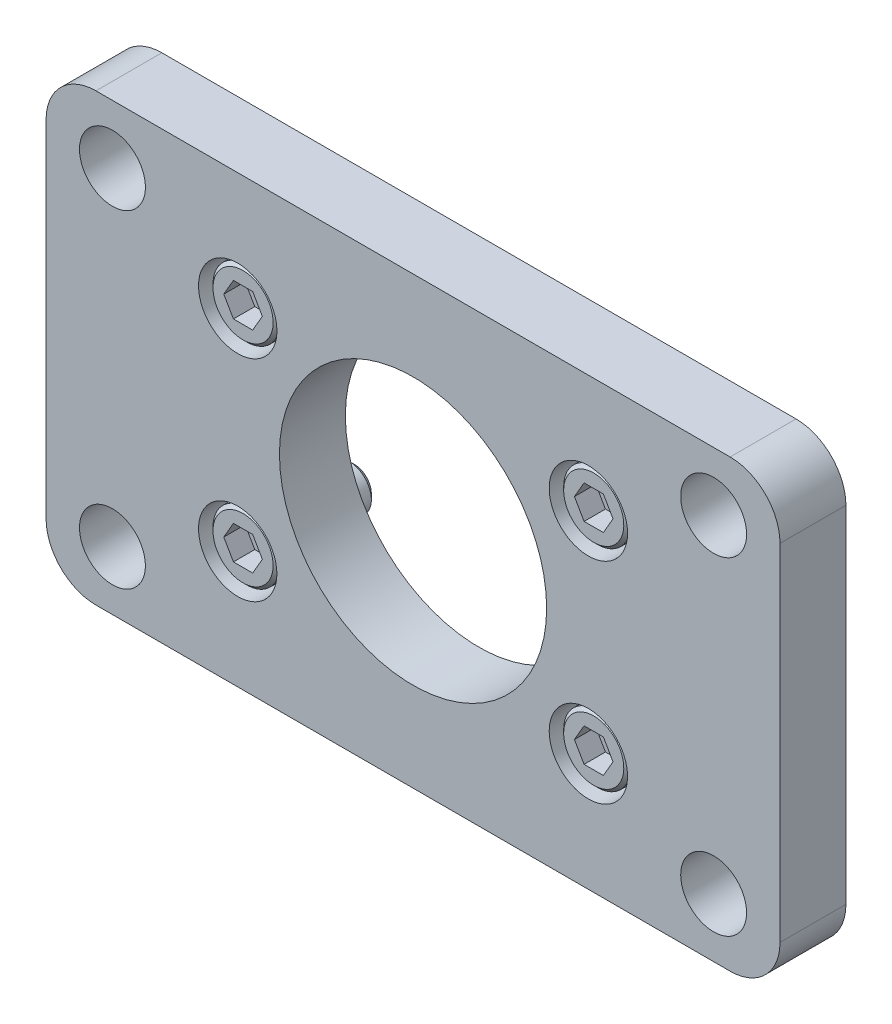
ISO-10303-21;
HEADER;
FILE_DESCRIPTION(('STEP AP214'),'2;1');
FILE_NAME('part.step','',(''),(''),'','','');
FILE_SCHEMA(('AUTOMOTIVE_DESIGN { 1 0 10303 214 1 1 1 1 }'));
ENDSEC;
DATA;
#1=APPLICATION_CONTEXT('core data for automotive mechanical design processes');
#2=APPLICATION_PROTOCOL_DEFINITION('international standard','automotive_design',2000,#1);
#3=PRODUCT_CONTEXT('',#1,'mechanical');
#4=PRODUCT('Part','Part','',(#3));
#5=PRODUCT_RELATED_PRODUCT_CATEGORY('part','',(#4));
#6=PRODUCT_DEFINITION_FORMATION('','',#4);
#7=PRODUCT_DEFINITION_CONTEXT('part definition',#1,'design');
#8=PRODUCT_DEFINITION('design','',#6,#7);
#9=PRODUCT_DEFINITION_SHAPE('','',#8);
#10=(LENGTH_UNIT() NAMED_UNIT(*) SI_UNIT(.MILLI.,.METRE.));
#11=(NAMED_UNIT(*) PLANE_ANGLE_UNIT() SI_UNIT($,.RADIAN.));
#12=(NAMED_UNIT(*) SI_UNIT($,.STERADIAN.) SOLID_ANGLE_UNIT());
#13=UNCERTAINTY_MEASURE_WITH_UNIT(LENGTH_MEASURE(1.E-05),#10,'distance_accuracy_value','');
#14=(GEOMETRIC_REPRESENTATION_CONTEXT(3) GLOBAL_UNCERTAINTY_ASSIGNED_CONTEXT((#13)) GLOBAL_UNIT_ASSIGNED_CONTEXT((#10,
#11,#12)) REPRESENTATION_CONTEXT('',''));
#15=CARTESIAN_POINT('',(0.,0.,0.));
#16=DIRECTION('',(0.,0.,1.));
#17=DIRECTION('',(1.,0.,0.));
#18=AXIS2_PLACEMENT_3D('',#15,#16,#17);
#19=CARTESIAN_POINT('',(29.1244459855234,-12.61875,-3.81));
#20=DIRECTION('',(0.,0.,1.));
#21=DIRECTION('',(0.,-1.,0.));
#22=AXIS2_PLACEMENT_3D('',#19,#20,#21);
#23=PLANE('',#22);
#24=DIRECTION('',(0.5,0.866025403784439,0.));
#25=VECTOR('',#24,1.);
#26=CARTESIAN_POINT('',(26.3748153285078,-17.38125,-3.81));
#27=LINE('',#26,#25);
#28=CARTESIAN_POINT('',(26.3748153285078,-17.38125,-3.81));
#29=VERTEX_POINT('',#28);
#30=CARTESIAN_POINT('',(27.7496306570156,-15.,-3.81));
#31=VERTEX_POINT('',#30);
#32=EDGE_CURVE('E584',#29,#31,#27,.T.);
#33=ORIENTED_EDGE('',*,*,#32,.T.);
#34=DIRECTION('',(-0.5,0.866025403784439,0.));
#35=VECTOR('',#34,1.);
#36=CARTESIAN_POINT('',(27.7496306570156,-15.,-3.81));
#37=LINE('',#36,#35);
#38=CARTESIAN_POINT('',(26.3748153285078,-12.61875,-3.81));
#39=VERTEX_POINT('',#38);
#40=EDGE_CURVE('E587',#31,#39,#37,.T.);
#41=ORIENTED_EDGE('',*,*,#40,.T.);
#42=DIRECTION('',(-1.,0.,0.));
#43=VECTOR('',#42,1.);
#44=CARTESIAN_POINT('',(26.3748153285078,-12.61875,-3.81));
#45=LINE('',#44,#43);
#46=CARTESIAN_POINT('',(23.6251846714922,-12.61875,-3.81));
#47=VERTEX_POINT('',#46);
#48=EDGE_CURVE('E590',#39,#47,#45,.T.);
#49=ORIENTED_EDGE('',*,*,#48,.T.);
#50=DIRECTION('',(-0.5,-0.866025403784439,0.));
#51=VECTOR('',#50,1.);
#52=CARTESIAN_POINT('',(23.6251846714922,-12.61875,-3.81));
#53=LINE('',#52,#51);
#54=CARTESIAN_POINT('',(22.2503693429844,-15.,-3.81));
#55=VERTEX_POINT('',#54);
#56=EDGE_CURVE('E593',#47,#55,#53,.T.);
#57=ORIENTED_EDGE('',*,*,#56,.T.);
#58=DIRECTION('',(0.5,-0.866025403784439,0.));
#59=VECTOR('',#58,1.);
#60=CARTESIAN_POINT('',(22.2503693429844,-15.,-3.81));
#61=LINE('',#60,#59);
#62=CARTESIAN_POINT('',(23.6251846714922,-17.38125,-3.81));
#63=VERTEX_POINT('',#62);
#64=EDGE_CURVE('E596',#55,#63,#61,.T.);
#65=ORIENTED_EDGE('',*,*,#64,.T.);
#66=DIRECTION('',(1.,0.,0.));
#67=VECTOR('',#66,1.);
#68=CARTESIAN_POINT('',(23.6251846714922,-17.38125,-3.81));
#69=LINE('',#68,#67);
#70=EDGE_CURVE('E599',#63,#29,#69,.T.);
#71=ORIENTED_EDGE('',*,*,#70,.T.);
#72=EDGE_LOOP('',(#33,#41,#49,#57,#65,#71));
#73=FACE_BOUND('',#72,.T.);
#74=ADVANCED_FACE('F14',(#73),#23,.T.);
#75=CARTESIAN_POINT('',(27.7496306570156,-15.,-3.81));
#76=DIRECTION('',(0.866025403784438,0.5,0.));
#77=DIRECTION('',(-0.5,0.866025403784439,0.));
#78=AXIS2_PLACEMENT_3D('',#75,#76,#77);
#79=PLANE('',#78);
#80=DIRECTION('',(-0.5,0.866025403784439,0.));
#81=VECTOR('',#80,1.);
#82=CARTESIAN_POINT('',(27.7496306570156,-15.,-0.762));
#83=LINE('',#82,#81);
#84=CARTESIAN_POINT('',(27.7496306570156,-15.,-0.762));
#85=VERTEX_POINT('',#84);
#86=CARTESIAN_POINT('',(26.3748153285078,-12.61875,-0.762));
#87=VERTEX_POINT('',#86);
#88=EDGE_CURVE('E570',#85,#87,#83,.T.);
#89=ORIENTED_EDGE('',*,*,#88,.T.);
#90=DIRECTION('',(0.,0.,1.));
#91=VECTOR('',#90,1.);
#92=CARTESIAN_POINT('',(26.3748153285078,-12.61875,-3.81));
#93=LINE('',#92,#91);
#94=EDGE_CURVE('E611',#39,#87,#93,.T.);
#95=ORIENTED_EDGE('',*,*,#94,.F.);
#96=ORIENTED_EDGE('',*,*,#40,.F.);
#97=DIRECTION('',(0.,0.,1.));
#98=VECTOR('',#97,1.);
#99=CARTESIAN_POINT('',(27.7496306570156,-15.,-3.81));
#100=LINE('',#99,#98);
#101=EDGE_CURVE('E602',#31,#85,#100,.T.);
#102=ORIENTED_EDGE('',*,*,#101,.T.);
#103=EDGE_LOOP('',(#89,#95,#96,#102));
#104=FACE_BOUND('',#103,.T.);
#105=ADVANCED_FACE('F923',(#104),#79,.F.);
#106=CARTESIAN_POINT('',(26.3748153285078,-12.61875,-3.81));
#107=DIRECTION('',(0.,1.,0.));
#108=DIRECTION('',(-1.,0.,0.));
#109=AXIS2_PLACEMENT_3D('',#106,#107,#108);
#110=PLANE('',#109);
#111=DIRECTION('',(-1.,0.,0.));
#112=VECTOR('',#111,1.);
#113=CARTESIAN_POINT('',(26.3748153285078,-12.61875,-0.762));
#114=LINE('',#113,#112);
#115=CARTESIAN_POINT('',(23.6251846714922,-12.61875,-0.762));
#116=VERTEX_POINT('',#115);
#117=EDGE_CURVE('E573',#87,#116,#114,.T.);
#118=ORIENTED_EDGE('',*,*,#117,.T.);
#119=DIRECTION('',(0.,0.,1.));
#120=VECTOR('',#119,1.);
#121=CARTESIAN_POINT('',(23.6251846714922,-12.61875,-3.81));
#122=LINE('',#121,#120);
#123=EDGE_CURVE('E609',#47,#116,#122,.T.);
#124=ORIENTED_EDGE('',*,*,#123,.F.);
#125=ORIENTED_EDGE('',*,*,#48,.F.);
#126=ORIENTED_EDGE('',*,*,#94,.T.);
#127=EDGE_LOOP('',(#118,#124,#125,#126));
#128=FACE_BOUND('',#127,.T.);
#129=ADVANCED_FACE('F936',(#128),#110,.F.);
#130=CARTESIAN_POINT('',(23.6251846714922,-12.61875,-3.81));
#131=DIRECTION('',(-0.866025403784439,0.5,0.));
#132=DIRECTION('',(-0.5,-0.866025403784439,0.));
#133=AXIS2_PLACEMENT_3D('',#130,#131,#132);
#134=PLANE('',#133);
#135=DIRECTION('',(-0.5,-0.866025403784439,0.));
#136=VECTOR('',#135,1.);
#137=CARTESIAN_POINT('',(23.6251846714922,-12.61875,-0.762));
#138=LINE('',#137,#136);
#139=CARTESIAN_POINT('',(22.2503693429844,-15.,-0.762));
#140=VERTEX_POINT('',#139);
#141=EDGE_CURVE('E576',#116,#140,#138,.T.);
#142=ORIENTED_EDGE('',*,*,#141,.T.);
#143=DIRECTION('',(0.,0.,1.));
#144=VECTOR('',#143,1.);
#145=CARTESIAN_POINT('',(22.2503693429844,-15.,-3.81));
#146=LINE('',#145,#144);
#147=EDGE_CURVE('E607',#55,#140,#146,.T.);
#148=ORIENTED_EDGE('',*,*,#147,.F.);
#149=ORIENTED_EDGE('',*,*,#56,.F.);
#150=ORIENTED_EDGE('',*,*,#123,.T.);
#151=EDGE_LOOP('',(#142,#148,#149,#150));
#152=FACE_BOUND('',#151,.T.);
#153=ADVANCED_FACE('F932',(#152),#134,.F.);
#154=CARTESIAN_POINT('',(22.2503693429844,-15.,-3.81));
#155=DIRECTION('',(-0.866025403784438,-0.5,0.));
#156=DIRECTION('',(0.5,-0.866025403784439,0.));
#157=AXIS2_PLACEMENT_3D('',#154,#155,#156);
#158=PLANE('',#157);
#159=DIRECTION('',(0.5,-0.866025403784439,0.));
#160=VECTOR('',#159,1.);
#161=CARTESIAN_POINT('',(22.2503693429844,-15.,-0.762));
#162=LINE('',#161,#160);
#163=CARTESIAN_POINT('',(23.6251846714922,-17.38125,-0.762));
#164=VERTEX_POINT('',#163);
#165=EDGE_CURVE('E579',#140,#164,#162,.T.);
#166=ORIENTED_EDGE('',*,*,#165,.T.);
#167=DIRECTION('',(0.,0.,1.));
#168=VECTOR('',#167,1.);
#169=CARTESIAN_POINT('',(23.6251846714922,-17.38125,-3.81));
#170=LINE('',#169,#168);
#171=EDGE_CURVE('E605',#63,#164,#170,.T.);
#172=ORIENTED_EDGE('',*,*,#171,.F.);
#173=ORIENTED_EDGE('',*,*,#64,.F.);
#174=ORIENTED_EDGE('',*,*,#147,.T.);
#175=EDGE_LOOP('',(#166,#172,#173,#174));
#176=FACE_BOUND('',#175,.T.);
#177=ADVANCED_FACE('F929',(#176),#158,.F.);
#178=CARTESIAN_POINT('',(23.6251846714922,-17.38125,-3.81));
#179=DIRECTION('',(0.,-1.,0.));
#180=DIRECTION('',(1.,0.,0.));
#181=AXIS2_PLACEMENT_3D('',#178,#179,#180);
#182=PLANE('',#181);
#183=DIRECTION('',(1.,0.,0.));
#184=VECTOR('',#183,1.);
#185=CARTESIAN_POINT('',(23.6251846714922,-17.38125,-0.762));
#186=LINE('',#185,#184);
#187=CARTESIAN_POINT('',(26.3748153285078,-17.38125,-0.762));
#188=VERTEX_POINT('',#187);
#189=EDGE_CURVE('E582',#164,#188,#186,.T.);
#190=ORIENTED_EDGE('',*,*,#189,.T.);
#191=DIRECTION('',(0.,0.,1.));
#192=VECTOR('',#191,1.);
#193=CARTESIAN_POINT('',(26.3748153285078,-17.38125,-3.81));
#194=LINE('',#193,#192);
#195=EDGE_CURVE('E36',#29,#188,#194,.T.);
#196=ORIENTED_EDGE('',*,*,#195,.F.);
#197=ORIENTED_EDGE('',*,*,#70,.F.);
#198=ORIENTED_EDGE('',*,*,#171,.T.);
#199=EDGE_LOOP('',(#190,#196,#197,#198));
#200=FACE_BOUND('',#199,.T.);
#201=ADVANCED_FACE('F925',(#200),#182,.F.);
#202=CARTESIAN_POINT('',(26.3748153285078,-17.38125,-3.81));
#203=DIRECTION('',(0.866025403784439,-0.5,0.));
#204=DIRECTION('',(0.5,0.866025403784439,0.));
#205=AXIS2_PLACEMENT_3D('',#202,#203,#204);
#206=PLANE('',#205);
#207=DIRECTION('',(0.5,0.866025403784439,0.));
#208=VECTOR('',#207,1.);
#209=CARTESIAN_POINT('',(26.3748153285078,-17.38125,-0.762));
#210=LINE('',#209,#208);
#211=EDGE_CURVE('E29',#188,#85,#210,.T.);
#212=ORIENTED_EDGE('',*,*,#211,.T.);
#213=ORIENTED_EDGE('',*,*,#101,.F.);
#214=ORIENTED_EDGE('',*,*,#32,.F.);
#215=ORIENTED_EDGE('',*,*,#195,.T.);
#216=EDGE_LOOP('',(#212,#213,#214,#215));
#217=FACE_BOUND('',#216,.T.);
#218=ADVANCED_FACE('F928',(#217),#206,.F.);
#219=CARTESIAN_POINT('',(29.28625,-15.,-0.762));
#220=DIRECTION('',(0.,0.,1.));
#221=DIRECTION('',(0.,-1.,0.));
#222=AXIS2_PLACEMENT_3D('',#219,#220,#221);
#223=PLANE('',#222);
#224=ORIENTED_EDGE('',*,*,#211,.F.);
#225=ORIENTED_EDGE('',*,*,#189,.F.);
#226=ORIENTED_EDGE('',*,*,#165,.F.);
#227=ORIENTED_EDGE('',*,*,#141,.F.);
#228=ORIENTED_EDGE('',*,*,#117,.F.);
#229=ORIENTED_EDGE('',*,*,#88,.F.);
#230=EDGE_LOOP('',(#224,#225,#226,#227,#228,#229));
#231=FACE_BOUND('',#230,.T.);
#232=CARTESIAN_POINT('',(25.,-15.,-0.762));
#233=DIRECTION('',(0.,0.,-1.));
#234=DIRECTION('',(0.,1.,0.));
#235=AXIS2_PLACEMENT_3D('',#232,#233,#234);
#236=CIRCLE('',#235,4.28625);
#237=CARTESIAN_POINT('',(25.,-10.71375,-0.762));
#238=VERTEX_POINT('',#237);
#239=EDGE_CURVE('E622',#238,#238,#236,.T.);
#240=ORIENTED_EDGE('',*,*,#239,.F.);
#241=EDGE_LOOP('',(#240));
#242=FACE_BOUND('',#241,.T.);
#243=ADVANCED_FACE('F644',(#231,#242),#223,.T.);
#244=CARTESIAN_POINT('',(25.,-15.,-1.23825));
#245=DIRECTION('',(0.,0.,-1.));
#246=DIRECTION('',(0.,1.,0.));
#247=AXIS2_PLACEMENT_3D('',#244,#245,#246);
#248=CONICAL_SURFACE('',#247,4.7625,0.785398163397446);
#249=ORIENTED_EDGE('',*,*,#239,.T.);
#250=EDGE_LOOP('',(#249));
#251=FACE_BOUND('',#250,.T.);
#252=CARTESIAN_POINT('',(25.,-15.,-1.23825));
#253=DIRECTION('',(0.,0.,-1.));
#254=DIRECTION('',(0.,1.,0.));
#255=AXIS2_PLACEMENT_3D('',#252,#253,#254);
#256=CIRCLE('',#255,4.7625);
#257=CARTESIAN_POINT('',(25.,-10.2375,-1.23825));
#258=VERTEX_POINT('',#257);
#259=EDGE_CURVE('E625',#258,#258,#256,.T.);
#260=ORIENTED_EDGE('',*,*,#259,.F.);
#261=EDGE_LOOP('',(#260));
#262=FACE_BOUND('',#261,.T.);
#263=ADVANCED_FACE('F635',(#251,#262),#248,.T.);
#264=CARTESIAN_POINT('',(25.,-15.,-7.112));
#265=DIRECTION('',(0.,0.,-1.));
#266=DIRECTION('',(0.,1.,0.));
#267=AXIS2_PLACEMENT_3D('',#264,#265,#266);
#268=CYLINDRICAL_SURFACE('',#267,4.7625);
#269=ORIENTED_EDGE('',*,*,#259,.T.);
#270=EDGE_LOOP('',(#269));
#271=FACE_BOUND('',#270,.T.);
#272=CARTESIAN_POINT('',(25.,-15.,-7.112));
#273=DIRECTION('',(0.,0.,-1.));
#274=DIRECTION('',(0.,1.,0.));
#275=AXIS2_PLACEMENT_3D('',#272,#273,#274);
#276=CIRCLE('',#275,4.7625);
#277=CARTESIAN_POINT('',(25.,-10.2375,-7.112));
#278=VERTEX_POINT('',#277);
#279=EDGE_CURVE('E22',#278,#278,#276,.T.);
#280=ORIENTED_EDGE('',*,*,#279,.F.);
#281=EDGE_LOOP('',(#280));
#282=FACE_BOUND('',#281,.T.);
#283=ADVANCED_FACE('F633',(#271,#282),#268,.T.);
#284=CARTESIAN_POINT('',(25.,-15.,-7.112));
#285=DIRECTION('',(0.,0.,-1.));
#286=DIRECTION('',(0.,1.,0.));
#287=AXIS2_PLACEMENT_3D('',#284,#285,#286);
#288=PLANE('',#287);
#289=CARTESIAN_POINT('',(25.,-15.,-7.112));
#290=DIRECTION('',(0.,0.,-1.));
#291=DIRECTION('',(-1.,0.,0.));
#292=AXIS2_PLACEMENT_3D('',#289,#290,#291);
#293=CIRCLE('',#292,3.3782);
#294=CARTESIAN_POINT('',(21.6218,-15.,-7.112));
#295=VERTEX_POINT('',#294);
#296=EDGE_CURVE('E9',#295,#295,#293,.F.);
#297=ORIENTED_EDGE('',*,*,#296,.F.);
#298=EDGE_LOOP('',(#297));
#299=FACE_BOUND('',#298,.T.);
#300=CARTESIAN_POINT('',(25.,-15.,-7.112));
#301=DIRECTION('',(0.,0.,1.));
#302=DIRECTION('',(0.,-1.,0.));
#303=AXIS2_PLACEMENT_3D('',#300,#301,#302);
#304=CIRCLE('',#303,3.175);
#305=CARTESIAN_POINT('',(25.,-18.175,-7.112));
#306=VERTEX_POINT('',#305);
#307=EDGE_CURVE('E604',#306,#306,#304,.T.);
#308=ORIENTED_EDGE('',*,*,#307,.T.);
#309=EDGE_LOOP('',(#308));
#310=FACE_BOUND('',#309,.T.);
#311=ADVANCED_FACE('F16',(#299,#310),#288,.T.);
#312=CARTESIAN_POINT('',(25.,-15.,-16.637));
#313=DIRECTION('',(0.,0.,1.));
#314=DIRECTION('',(0.,-1.,0.));
#315=AXIS2_PLACEMENT_3D('',#312,#313,#314);
#316=PLANE('',#315);
#317=CARTESIAN_POINT('',(25.,-15.,-16.637));
#318=DIRECTION('',(0.,0.,1.));
#319=DIRECTION('',(0.,-1.,0.));
#320=AXIS2_PLACEMENT_3D('',#317,#318,#319);
#321=CIRCLE('',#320,2.41935);
#322=CARTESIAN_POINT('',(25.,-17.41935,-16.637));
#323=VERTEX_POINT('',#322);
#324=EDGE_CURVE('E619',#323,#323,#321,.T.);
#325=ORIENTED_EDGE('',*,*,#324,.F.);
#326=EDGE_LOOP('',(#325));
#327=FACE_BOUND('',#326,.T.);
#328=ADVANCED_FACE('F642',(#327),#316,.F.);
#329=CARTESIAN_POINT('',(25.,-15.,-16.637));
#330=DIRECTION('',(0.,0.,1.));
#331=DIRECTION('',(0.,-1.,0.));
#332=AXIS2_PLACEMENT_3D('',#329,#330,#331);
#333=CONICAL_SURFACE('',#332,2.41935,0.785398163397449);
#334=CARTESIAN_POINT('',(25.,-15.,-15.88135));
#335=DIRECTION('',(0.,0.,1.));
#336=DIRECTION('',(0.,-1.,0.));
#337=AXIS2_PLACEMENT_3D('',#334,#335,#336);
#338=CIRCLE('',#337,3.175);
#339=CARTESIAN_POINT('',(25.,-18.175,-15.88135));
#340=VERTEX_POINT('',#339);
#341=EDGE_CURVE('E616',#340,#340,#338,.T.);
#342=ORIENTED_EDGE('',*,*,#341,.F.);
#343=EDGE_LOOP('',(#342));
#344=FACE_BOUND('',#343,.T.);
#345=ORIENTED_EDGE('',*,*,#324,.T.);
#346=EDGE_LOOP('',(#345));
#347=FACE_BOUND('',#346,.T.);
#348=ADVANCED_FACE('F948',(#344,#347),#333,.T.);
#349=CARTESIAN_POINT('',(25.,-15.,-7.112));
#350=DIRECTION('',(0.,0.,1.));
#351=DIRECTION('',(0.,-1.,0.));
#352=AXIS2_PLACEMENT_3D('',#349,#350,#351);
#353=CYLINDRICAL_SURFACE('',#352,3.175);
#354=ORIENTED_EDGE('',*,*,#307,.F.);
#355=EDGE_LOOP('',(#354));
#356=FACE_BOUND('',#355,.T.);
#357=ORIENTED_EDGE('',*,*,#341,.T.);
#358=EDGE_LOOP('',(#357));
#359=FACE_BOUND('',#358,.T.);
#360=ADVANCED_FACE('F890',(#356,#359),#353,.T.);
#361=CARTESIAN_POINT('',(-20.8755540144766,17.38125,-3.81));
#362=DIRECTION('',(0.,0.,1.));
#363=DIRECTION('',(0.,-1.,0.));
#364=AXIS2_PLACEMENT_3D('',#361,#362,#363);
#365=PLANE('',#364);
#366=DIRECTION('',(0.5,0.866025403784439,0.));
#367=VECTOR('',#366,1.);
#368=CARTESIAN_POINT('',(-23.6251846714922,12.61875,-3.81));
#369=LINE('',#368,#367);
#370=CARTESIAN_POINT('',(-23.6251846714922,12.61875,-3.81));
#371=VERTEX_POINT('',#370);
#372=CARTESIAN_POINT('',(-22.2503693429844,15.,-3.81));
#373=VERTEX_POINT('',#372);
#374=EDGE_CURVE('E517',#371,#373,#369,.T.);
#375=ORIENTED_EDGE('',*,*,#374,.T.);
#376=DIRECTION('',(-0.5,0.866025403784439,0.));
#377=VECTOR('',#376,1.);
#378=CARTESIAN_POINT('',(-22.2503693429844,15.,-3.81));
#379=LINE('',#378,#377);
#380=CARTESIAN_POINT('',(-23.6251846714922,17.38125,-3.81));
#381=VERTEX_POINT('',#380);
#382=EDGE_CURVE('E520',#373,#381,#379,.T.);
#383=ORIENTED_EDGE('',*,*,#382,.T.);
#384=DIRECTION('',(-1.,0.,0.));
#385=VECTOR('',#384,1.);
#386=CARTESIAN_POINT('',(-23.6251846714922,17.38125,-3.81));
#387=LINE('',#386,#385);
#388=CARTESIAN_POINT('',(-26.3748153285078,17.38125,-3.81));
#389=VERTEX_POINT('',#388);
#390=EDGE_CURVE('E523',#381,#389,#387,.T.);
#391=ORIENTED_EDGE('',*,*,#390,.T.);
#392=DIRECTION('',(-0.5,-0.866025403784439,0.));
#393=VECTOR('',#392,1.);
#394=CARTESIAN_POINT('',(-26.3748153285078,17.38125,-3.81));
#395=LINE('',#394,#393);
#396=CARTESIAN_POINT('',(-27.7496306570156,15.,-3.81));
#397=VERTEX_POINT('',#396);
#398=EDGE_CURVE('E526',#389,#397,#395,.T.);
#399=ORIENTED_EDGE('',*,*,#398,.T.);
#400=DIRECTION('',(0.5,-0.866025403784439,0.));
#401=VECTOR('',#400,1.);
#402=CARTESIAN_POINT('',(-27.7496306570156,15.,-3.81));
#403=LINE('',#402,#401);
#404=CARTESIAN_POINT('',(-26.3748153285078,12.61875,-3.81));
#405=VERTEX_POINT('',#404);
#406=EDGE_CURVE('E529',#397,#405,#403,.T.);
#407=ORIENTED_EDGE('',*,*,#406,.T.);
#408=DIRECTION('',(1.,0.,0.));
#409=VECTOR('',#408,1.);
#410=CARTESIAN_POINT('',(-26.3748153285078,12.61875,-3.81));
#411=LINE('',#410,#409);
#412=EDGE_CURVE('E532',#405,#371,#411,.T.);
#413=ORIENTED_EDGE('',*,*,#412,.T.);
#414=EDGE_LOOP('',(#375,#383,#391,#399,#407,#413));
#415=FACE_BOUND('',#414,.T.);
#416=ADVANCED_FACE('F752',(#415),#365,.T.);
#417=CARTESIAN_POINT('',(29.1244459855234,17.38125,-3.81));
#418=DIRECTION('',(0.,0.,1.));
#419=DIRECTION('',(0.,-1.,0.));
#420=AXIS2_PLACEMENT_3D('',#417,#418,#419);
#421=PLANE('',#420);
#422=DIRECTION('',(0.5,0.866025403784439,0.));
#423=VECTOR('',#422,1.);
#424=CARTESIAN_POINT('',(26.3748153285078,12.61875,-3.81));
#425=LINE('',#424,#423);
#426=CARTESIAN_POINT('',(26.3748153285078,12.61875,-3.81));
#427=VERTEX_POINT('',#426);
#428=CARTESIAN_POINT('',(27.7496306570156,15.,-3.81));
#429=VERTEX_POINT('',#428);
#430=EDGE_CURVE('E316',#427,#429,#425,.T.);
#431=ORIENTED_EDGE('',*,*,#430,.T.);
#432=DIRECTION('',(-0.5,0.866025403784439,0.));
#433=VECTOR('',#432,1.);
#434=CARTESIAN_POINT('',(27.7496306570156,15.,-3.81));
#435=LINE('',#434,#433);
#436=CARTESIAN_POINT('',(26.3748153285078,17.38125,-3.81));
#437=VERTEX_POINT('',#436);
#438=EDGE_CURVE('E319',#429,#437,#435,.T.);
#439=ORIENTED_EDGE('',*,*,#438,.T.);
#440=DIRECTION('',(-1.,0.,0.));
#441=VECTOR('',#440,1.);
#442=CARTESIAN_POINT('',(26.3748153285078,17.38125,-3.81));
#443=LINE('',#442,#441);
#444=CARTESIAN_POINT('',(23.6251846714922,17.38125,-3.81));
#445=VERTEX_POINT('',#444);
#446=EDGE_CURVE('E322',#437,#445,#443,.T.);
#447=ORIENTED_EDGE('',*,*,#446,.T.);
#448=DIRECTION('',(-0.5,-0.866025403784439,0.));
#449=VECTOR('',#448,1.);
#450=CARTESIAN_POINT('',(23.6251846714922,17.38125,-3.81));
#451=LINE('',#450,#449);
#452=CARTESIAN_POINT('',(22.2503693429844,15.,-3.81));
#453=VERTEX_POINT('',#452);
#454=EDGE_CURVE('E325',#445,#453,#451,.T.);
#455=ORIENTED_EDGE('',*,*,#454,.T.);
#456=DIRECTION('',(0.5,-0.866025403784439,0.));
#457=VECTOR('',#456,1.);
#458=CARTESIAN_POINT('',(22.2503693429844,15.,-3.81));
#459=LINE('',#458,#457);
#460=CARTESIAN_POINT('',(23.6251846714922,12.61875,-3.81));
#461=VERTEX_POINT('',#460);
#462=EDGE_CURVE('E328',#453,#461,#459,.T.);
#463=ORIENTED_EDGE('',*,*,#462,.T.);
#464=DIRECTION('',(1.,0.,0.));
#465=VECTOR('',#464,1.);
#466=CARTESIAN_POINT('',(23.6251846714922,12.61875,-3.81));
#467=LINE('',#466,#465);
#468=EDGE_CURVE('E331',#461,#427,#467,.T.);
#469=ORIENTED_EDGE('',*,*,#468,.T.);
#470=EDGE_LOOP('',(#431,#439,#447,#455,#463,#469));
#471=FACE_BOUND('',#470,.T.);
#472=ADVANCED_FACE('F755',(#471),#421,.T.);
#473=CARTESIAN_POINT('',(-20.8755540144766,-12.61875,-3.81));
#474=DIRECTION('',(0.,0.,1.));
#475=DIRECTION('',(0.,-1.,0.));
#476=AXIS2_PLACEMENT_3D('',#473,#474,#475);
#477=PLANE('',#476);
#478=DIRECTION('',(0.5,0.866025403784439,0.));
#479=VECTOR('',#478,1.);
#480=CARTESIAN_POINT('',(-23.6251846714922,-17.38125,-3.81));
#481=LINE('',#480,#479);
#482=CARTESIAN_POINT('',(-23.6251846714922,-17.38125,-3.81));
#483=VERTEX_POINT('',#482);
#484=CARTESIAN_POINT('',(-22.2503693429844,-15.,-3.81));
#485=VERTEX_POINT('',#484);
#486=EDGE_CURVE('E261',#483,#485,#481,.T.);
#487=ORIENTED_EDGE('',*,*,#486,.T.);
#488=DIRECTION('',(-0.5,0.866025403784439,0.));
#489=VECTOR('',#488,1.);
#490=CARTESIAN_POINT('',(-22.2503693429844,-15.,-3.81));
#491=LINE('',#490,#489);
#492=CARTESIAN_POINT('',(-23.6251846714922,-12.61875,-3.81));
#493=VERTEX_POINT('',#492);
#494=EDGE_CURVE('E264',#485,#493,#491,.T.);
#495=ORIENTED_EDGE('',*,*,#494,.T.);
#496=DIRECTION('',(-1.,0.,0.));
#497=VECTOR('',#496,1.);
#498=CARTESIAN_POINT('',(-23.6251846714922,-12.61875,-3.81));
#499=LINE('',#498,#497);
#500=CARTESIAN_POINT('',(-26.3748153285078,-12.61875,-3.81));
#501=VERTEX_POINT('',#500);
#502=EDGE_CURVE('E231',#493,#501,#499,.T.);
#503=ORIENTED_EDGE('',*,*,#502,.T.);
#504=DIRECTION('',(-0.5,-0.866025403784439,0.));
#505=VECTOR('',#504,1.);
#506=CARTESIAN_POINT('',(-26.3748153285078,-12.61875,-3.81));
#507=LINE('',#506,#505);
#508=CARTESIAN_POINT('',(-27.7496306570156,-15.,-3.81));
#509=VERTEX_POINT('',#508);
#510=EDGE_CURVE('E267',#501,#509,#507,.T.);
#511=ORIENTED_EDGE('',*,*,#510,.T.);
#512=DIRECTION('',(0.5,-0.866025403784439,0.));
#513=VECTOR('',#512,1.);
#514=CARTESIAN_POINT('',(-27.7496306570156,-15.,-3.81));
#515=LINE('',#514,#513);
#516=CARTESIAN_POINT('',(-26.3748153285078,-17.38125,-3.81));
#517=VERTEX_POINT('',#516);
#518=EDGE_CURVE('E270',#509,#517,#515,.T.);
#519=ORIENTED_EDGE('',*,*,#518,.T.);
#520=DIRECTION('',(1.,0.,0.));
#521=VECTOR('',#520,1.);
#522=CARTESIAN_POINT('',(-26.3748153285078,-17.38125,-3.81));
#523=LINE('',#522,#521);
#524=EDGE_CURVE('E273',#517,#483,#523,.T.);
#525=ORIENTED_EDGE('',*,*,#524,.T.);
#526=EDGE_LOOP('',(#487,#495,#503,#511,#519,#525));
#527=FACE_BOUND('',#526,.T.);
#528=ADVANCED_FACE('F758',(#527),#477,.T.);
#529=CARTESIAN_POINT('',(-22.2503693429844,15.,-3.81));
#530=DIRECTION('',(0.866025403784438,0.5,0.));
#531=DIRECTION('',(-0.5,0.866025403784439,0.));
#532=AXIS2_PLACEMENT_3D('',#529,#530,#531);
#533=PLANE('',#532);
#534=DIRECTION('',(-0.5,0.866025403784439,0.));
#535=VECTOR('',#534,1.);
#536=CARTESIAN_POINT('',(-22.2503693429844,15.,-0.762));
#537=LINE('',#536,#535);
#538=CARTESIAN_POINT('',(-22.2503693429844,15.,-0.762));
#539=VERTEX_POINT('',#538);
#540=CARTESIAN_POINT('',(-23.6251846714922,17.38125,-0.762));
#541=VERTEX_POINT('',#540);
#542=EDGE_CURVE('E502',#539,#541,#537,.T.);
#543=ORIENTED_EDGE('',*,*,#542,.T.);
#544=DIRECTION('',(0.,0.,1.));
#545=VECTOR('',#544,1.);
#546=CARTESIAN_POINT('',(-23.6251846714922,17.38125,-3.81));
#547=LINE('',#546,#545);
#548=EDGE_CURVE('E545',#381,#541,#547,.T.);
#549=ORIENTED_EDGE('',*,*,#548,.F.);
#550=ORIENTED_EDGE('',*,*,#382,.F.);
#551=DIRECTION('',(0.,0.,1.));
#552=VECTOR('',#551,1.);
#553=CARTESIAN_POINT('',(-22.2503693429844,15.,-3.81));
#554=LINE('',#553,#552);
#555=EDGE_CURVE('E535',#373,#539,#554,.T.);
#556=ORIENTED_EDGE('',*,*,#555,.T.);
#557=EDGE_LOOP('',(#543,#549,#550,#556));
#558=FACE_BOUND('',#557,.T.);
#559=ADVANCED_FACE('F892',(#558),#533,.F.);
#560=CARTESIAN_POINT('',(-23.6251846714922,17.38125,-3.81));
#561=DIRECTION('',(0.,1.,0.));
#562=DIRECTION('',(-1.,0.,0.));
#563=AXIS2_PLACEMENT_3D('',#560,#561,#562);
#564=PLANE('',#563);
#565=DIRECTION('',(-1.,0.,0.));
#566=VECTOR('',#565,1.);
#567=CARTESIAN_POINT('',(-23.6251846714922,17.38125,-0.762));
#568=LINE('',#567,#566);
#569=CARTESIAN_POINT('',(-26.3748153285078,17.38125,-0.762));
#570=VERTEX_POINT('',#569);
#571=EDGE_CURVE('E505',#541,#570,#568,.T.);
#572=ORIENTED_EDGE('',*,*,#571,.T.);
#573=DIRECTION('',(0.,0.,1.));
#574=VECTOR('',#573,1.);
#575=CARTESIAN_POINT('',(-26.3748153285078,17.38125,-3.81));
#576=LINE('',#575,#574);
#577=EDGE_CURVE('E543',#389,#570,#576,.T.);
#578=ORIENTED_EDGE('',*,*,#577,.F.);
#579=ORIENTED_EDGE('',*,*,#390,.F.);
#580=ORIENTED_EDGE('',*,*,#548,.T.);
#581=EDGE_LOOP('',(#572,#578,#579,#580));
#582=FACE_BOUND('',#581,.T.);
#583=ADVANCED_FACE('F904',(#582),#564,.F.);
#584=CARTESIAN_POINT('',(-26.3748153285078,17.38125,-3.81));
#585=DIRECTION('',(-0.866025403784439,0.5,0.));
#586=DIRECTION('',(-0.5,-0.866025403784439,0.));
#587=AXIS2_PLACEMENT_3D('',#584,#585,#586);
#588=PLANE('',#587);
#589=DIRECTION('',(-0.5,-0.866025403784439,0.));
#590=VECTOR('',#589,1.);
#591=CARTESIAN_POINT('',(-26.3748153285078,17.38125,-0.762));
#592=LINE('',#591,#590);
#593=CARTESIAN_POINT('',(-27.7496306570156,15.,-0.762));
#594=VERTEX_POINT('',#593);
#595=EDGE_CURVE('E508',#570,#594,#592,.T.);
#596=ORIENTED_EDGE('',*,*,#595,.T.);
#597=DIRECTION('',(0.,0.,1.));
#598=VECTOR('',#597,1.);
#599=CARTESIAN_POINT('',(-27.7496306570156,15.,-3.81));
#600=LINE('',#599,#598);
#601=EDGE_CURVE('E541',#397,#594,#600,.T.);
#602=ORIENTED_EDGE('',*,*,#601,.F.);
#603=ORIENTED_EDGE('',*,*,#398,.F.);
#604=ORIENTED_EDGE('',*,*,#577,.T.);
#605=EDGE_LOOP('',(#596,#602,#603,#604));
#606=FACE_BOUND('',#605,.T.);
#607=ADVANCED_FACE('F900',(#606),#588,.F.);
#608=CARTESIAN_POINT('',(-27.7496306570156,15.,-3.81));
#609=DIRECTION('',(-0.866025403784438,-0.5,0.));
#610=DIRECTION('',(0.5,-0.866025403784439,0.));
#611=AXIS2_PLACEMENT_3D('',#608,#609,#610);
#612=PLANE('',#611);
#613=DIRECTION('',(0.5,-0.866025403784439,0.));
#614=VECTOR('',#613,1.);
#615=CARTESIAN_POINT('',(-27.7496306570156,15.,-0.762));
#616=LINE('',#615,#614);
#617=CARTESIAN_POINT('',(-26.3748153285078,12.61875,-0.762));
#618=VERTEX_POINT('',#617);
#619=EDGE_CURVE('E511',#594,#618,#616,.T.);
#620=ORIENTED_EDGE('',*,*,#619,.T.);
#621=DIRECTION('',(0.,0.,1.));
#622=VECTOR('',#621,1.);
#623=CARTESIAN_POINT('',(-26.3748153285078,12.61875,-3.81));
#624=LINE('',#623,#622);
#625=EDGE_CURVE('E539',#405,#618,#624,.T.);
#626=ORIENTED_EDGE('',*,*,#625,.F.);
#627=ORIENTED_EDGE('',*,*,#406,.F.);
#628=ORIENTED_EDGE('',*,*,#601,.T.);
#629=EDGE_LOOP('',(#620,#626,#627,#628));
#630=FACE_BOUND('',#629,.T.);
#631=ADVANCED_FACE('F896',(#630),#612,.F.);
#632=CARTESIAN_POINT('',(-26.3748153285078,12.61875,-3.81));
#633=DIRECTION('',(0.,-1.,0.));
#634=DIRECTION('',(1.,0.,0.));
#635=AXIS2_PLACEMENT_3D('',#632,#633,#634);
#636=PLANE('',#635);
#637=DIRECTION('',(1.,0.,0.));
#638=VECTOR('',#637,1.);
#639=CARTESIAN_POINT('',(-26.3748153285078,12.61875,-0.762));
#640=LINE('',#639,#638);
#641=CARTESIAN_POINT('',(-23.6251846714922,12.61875,-0.762));
#642=VERTEX_POINT('',#641);
#643=EDGE_CURVE('E514',#618,#642,#640,.T.);
#644=ORIENTED_EDGE('',*,*,#643,.T.);
#645=DIRECTION('',(0.,0.,1.));
#646=VECTOR('',#645,1.);
#647=CARTESIAN_POINT('',(-23.6251846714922,12.61875,-3.81));
#648=LINE('',#647,#646);
#649=EDGE_CURVE('E536',#371,#642,#648,.T.);
#650=ORIENTED_EDGE('',*,*,#649,.F.);
#651=ORIENTED_EDGE('',*,*,#412,.F.);
#652=ORIENTED_EDGE('',*,*,#625,.T.);
#653=EDGE_LOOP('',(#644,#650,#651,#652));
#654=FACE_BOUND('',#653,.T.);
#655=ADVANCED_FACE('F893',(#654),#636,.F.);
#656=CARTESIAN_POINT('',(-23.6251846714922,12.61875,-3.81));
#657=DIRECTION('',(0.866025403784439,-0.5,0.));
#658=DIRECTION('',(0.5,0.866025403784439,0.));
#659=AXIS2_PLACEMENT_3D('',#656,#657,#658);
#660=PLANE('',#659);
#661=DIRECTION('',(0.5,0.866025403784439,0.));
#662=VECTOR('',#661,1.);
#663=CARTESIAN_POINT('',(-23.6251846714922,12.61875,-0.762));
#664=LINE('',#663,#662);
#665=EDGE_CURVE('E500',#642,#539,#664,.T.);
#666=ORIENTED_EDGE('',*,*,#665,.T.);
#667=ORIENTED_EDGE('',*,*,#555,.F.);
#668=ORIENTED_EDGE('',*,*,#374,.F.);
#669=ORIENTED_EDGE('',*,*,#649,.T.);
#670=EDGE_LOOP('',(#666,#667,#668,#669));
#671=FACE_BOUND('',#670,.T.);
#672=ADVANCED_FACE('F711',(#671),#660,.F.);
#673=CARTESIAN_POINT('',(27.7496306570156,15.,-3.81));
#674=DIRECTION('',(0.866025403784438,0.5,0.));
#675=DIRECTION('',(-0.5,0.866025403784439,0.));
#676=AXIS2_PLACEMENT_3D('',#673,#674,#675);
#677=PLANE('',#676);
#678=DIRECTION('',(-0.5,0.866025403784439,0.));
#679=VECTOR('',#678,1.);
#680=CARTESIAN_POINT('',(27.7496306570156,15.,-0.762));
#681=LINE('',#680,#679);
#682=CARTESIAN_POINT('',(27.7496306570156,15.,-0.762));
#683=VERTEX_POINT('',#682);
#684=CARTESIAN_POINT('',(26.3748153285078,17.38125,-0.762));
#685=VERTEX_POINT('',#684);
#686=EDGE_CURVE('E301',#683,#685,#681,.T.);
#687=ORIENTED_EDGE('',*,*,#686,.T.);
#688=DIRECTION('',(0.,0.,1.));
#689=VECTOR('',#688,1.);
#690=CARTESIAN_POINT('',(26.3748153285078,17.38125,-3.81));
#691=LINE('',#690,#689);
#692=EDGE_CURVE('E344',#437,#685,#691,.T.);
#693=ORIENTED_EDGE('',*,*,#692,.F.);
#694=ORIENTED_EDGE('',*,*,#438,.F.);
#695=DIRECTION('',(0.,0.,1.));
#696=VECTOR('',#695,1.);
#697=CARTESIAN_POINT('',(27.7496306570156,15.,-3.81));
#698=LINE('',#697,#696);
#699=EDGE_CURVE('E334',#429,#683,#698,.T.);
#700=ORIENTED_EDGE('',*,*,#699,.T.);
#701=EDGE_LOOP('',(#687,#693,#694,#700));
#702=FACE_BOUND('',#701,.T.);
#703=ADVANCED_FACE('F760',(#702),#677,.F.);
#704=CARTESIAN_POINT('',(26.3748153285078,17.38125,-3.81));
#705=DIRECTION('',(0.,1.,0.));
#706=DIRECTION('',(-1.,0.,0.));
#707=AXIS2_PLACEMENT_3D('',#704,#705,#706);
#708=PLANE('',#707);
#709=DIRECTION('',(-1.,0.,0.));
#710=VECTOR('',#709,1.);
#711=CARTESIAN_POINT('',(26.3748153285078,17.38125,-0.762));
#712=LINE('',#711,#710);
#713=CARTESIAN_POINT('',(23.6251846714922,17.38125,-0.762));
#714=VERTEX_POINT('',#713);
#715=EDGE_CURVE('E304',#685,#714,#712,.T.);
#716=ORIENTED_EDGE('',*,*,#715,.T.);
#717=DIRECTION('',(0.,0.,1.));
#718=VECTOR('',#717,1.);
#719=CARTESIAN_POINT('',(23.6251846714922,17.38125,-3.81));
#720=LINE('',#719,#718);
#721=EDGE_CURVE('E342',#445,#714,#720,.T.);
#722=ORIENTED_EDGE('',*,*,#721,.F.);
#723=ORIENTED_EDGE('',*,*,#446,.F.);
#724=ORIENTED_EDGE('',*,*,#692,.T.);
#725=EDGE_LOOP('',(#716,#722,#723,#724));
#726=FACE_BOUND('',#725,.T.);
#727=ADVANCED_FACE('F772',(#726),#708,.F.);
#728=CARTESIAN_POINT('',(23.6251846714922,17.38125,-3.81));
#729=DIRECTION('',(-0.866025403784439,0.5,0.));
#730=DIRECTION('',(-0.5,-0.866025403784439,0.));
#731=AXIS2_PLACEMENT_3D('',#728,#729,#730);
#732=PLANE('',#731);
#733=DIRECTION('',(-0.5,-0.866025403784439,0.));
#734=VECTOR('',#733,1.);
#735=CARTESIAN_POINT('',(23.6251846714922,17.38125,-0.762));
#736=LINE('',#735,#734);
#737=CARTESIAN_POINT('',(22.2503693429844,15.,-0.762));
#738=VERTEX_POINT('',#737);
#739=EDGE_CURVE('E307',#714,#738,#736,.T.);
#740=ORIENTED_EDGE('',*,*,#739,.T.);
#741=DIRECTION('',(0.,0.,1.));
#742=VECTOR('',#741,1.);
#743=CARTESIAN_POINT('',(22.2503693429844,15.,-3.81));
#744=LINE('',#743,#742);
#745=EDGE_CURVE('E340',#453,#738,#744,.T.);
#746=ORIENTED_EDGE('',*,*,#745,.F.);
#747=ORIENTED_EDGE('',*,*,#454,.F.);
#748=ORIENTED_EDGE('',*,*,#721,.T.);
#749=EDGE_LOOP('',(#740,#746,#747,#748));
#750=FACE_BOUND('',#749,.T.);
#751=ADVANCED_FACE('F768',(#750),#732,.F.);
#752=CARTESIAN_POINT('',(22.2503693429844,15.,-3.81));
#753=DIRECTION('',(-0.866025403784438,-0.5,0.));
#754=DIRECTION('',(0.5,-0.866025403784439,0.));
#755=AXIS2_PLACEMENT_3D('',#752,#753,#754);
#756=PLANE('',#755);
#757=DIRECTION('',(0.5,-0.866025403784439,0.));
#758=VECTOR('',#757,1.);
#759=CARTESIAN_POINT('',(22.2503693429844,15.,-0.762));
#760=LINE('',#759,#758);
#761=CARTESIAN_POINT('',(23.6251846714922,12.61875,-0.762));
#762=VERTEX_POINT('',#761);
#763=EDGE_CURVE('E310',#738,#762,#760,.T.);
#764=ORIENTED_EDGE('',*,*,#763,.T.);
#765=DIRECTION('',(0.,0.,1.));
#766=VECTOR('',#765,1.);
#767=CARTESIAN_POINT('',(23.6251846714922,12.61875,-3.81));
#768=LINE('',#767,#766);
#769=EDGE_CURVE('E338',#461,#762,#768,.T.);
#770=ORIENTED_EDGE('',*,*,#769,.F.);
#771=ORIENTED_EDGE('',*,*,#462,.F.);
#772=ORIENTED_EDGE('',*,*,#745,.T.);
#773=EDGE_LOOP('',(#764,#770,#771,#772));
#774=FACE_BOUND('',#773,.T.);
#775=ADVANCED_FACE('F764',(#774),#756,.F.);
#776=CARTESIAN_POINT('',(23.6251846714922,12.61875,-3.81));
#777=DIRECTION('',(0.,-1.,0.));
#778=DIRECTION('',(1.,0.,0.));
#779=AXIS2_PLACEMENT_3D('',#776,#777,#778);
#780=PLANE('',#779);
#781=DIRECTION('',(1.,0.,0.));
#782=VECTOR('',#781,1.);
#783=CARTESIAN_POINT('',(23.6251846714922,12.61875,-0.762));
#784=LINE('',#783,#782);
#785=CARTESIAN_POINT('',(26.3748153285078,12.61875,-0.762));
#786=VERTEX_POINT('',#785);
#787=EDGE_CURVE('E313',#762,#786,#784,.T.);
#788=ORIENTED_EDGE('',*,*,#787,.T.);
#789=DIRECTION('',(0.,0.,1.));
#790=VECTOR('',#789,1.);
#791=CARTESIAN_POINT('',(26.3748153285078,12.61875,-3.81));
#792=LINE('',#791,#790);
#793=EDGE_CURVE('E335',#427,#786,#792,.T.);
#794=ORIENTED_EDGE('',*,*,#793,.F.);
#795=ORIENTED_EDGE('',*,*,#468,.F.);
#796=ORIENTED_EDGE('',*,*,#769,.T.);
#797=EDGE_LOOP('',(#788,#794,#795,#796));
#798=FACE_BOUND('',#797,.T.);
#799=ADVANCED_FACE('F761',(#798),#780,.F.);
#800=CARTESIAN_POINT('',(26.3748153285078,12.61875,-3.81));
#801=DIRECTION('',(0.866025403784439,-0.5,0.));
#802=DIRECTION('',(0.5,0.866025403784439,0.));
#803=AXIS2_PLACEMENT_3D('',#800,#801,#802);
#804=PLANE('',#803);
#805=DIRECTION('',(0.5,0.866025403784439,0.));
#806=VECTOR('',#805,1.);
#807=CARTESIAN_POINT('',(26.3748153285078,12.61875,-0.762));
#808=LINE('',#807,#806);
#809=EDGE_CURVE('E299',#786,#683,#808,.T.);
#810=ORIENTED_EDGE('',*,*,#809,.T.);
#811=ORIENTED_EDGE('',*,*,#699,.F.);
#812=ORIENTED_EDGE('',*,*,#430,.F.);
#813=ORIENTED_EDGE('',*,*,#793,.T.);
#814=EDGE_LOOP('',(#810,#811,#812,#813));
#815=FACE_BOUND('',#814,.T.);
#816=ADVANCED_FACE('F699',(#815),#804,.F.);
#817=CARTESIAN_POINT('',(-22.2503693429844,-15.,-3.81));
#818=DIRECTION('',(0.866025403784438,0.5,0.));
#819=DIRECTION('',(-0.5,0.866025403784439,0.));
#820=AXIS2_PLACEMENT_3D('',#817,#818,#819);
#821=PLANE('',#820);
#822=DIRECTION('',(-0.5,0.866025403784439,0.));
#823=VECTOR('',#822,1.);
#824=CARTESIAN_POINT('',(-22.2503693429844,-15.,-0.762));
#825=LINE('',#824,#823);
#826=CARTESIAN_POINT('',(-22.2503693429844,-15.,-0.762));
#827=VERTEX_POINT('',#826);
#828=CARTESIAN_POINT('',(-23.6251846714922,-12.61875,-0.762));
#829=VERTEX_POINT('',#828);
#830=EDGE_CURVE('E240',#827,#829,#825,.T.);
#831=ORIENTED_EDGE('',*,*,#830,.T.);
#832=DIRECTION('',(0.,0.,1.));
#833=VECTOR('',#832,1.);
#834=CARTESIAN_POINT('',(-23.6251846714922,-12.61875,-3.81));
#835=LINE('',#834,#833);
#836=EDGE_CURVE('E224',#493,#829,#835,.T.);
#837=ORIENTED_EDGE('',*,*,#836,.F.);
#838=ORIENTED_EDGE('',*,*,#494,.F.);
#839=DIRECTION('',(0.,0.,1.));
#840=VECTOR('',#839,1.);
#841=CARTESIAN_POINT('',(-22.2503693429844,-15.,-3.81));
#842=LINE('',#841,#840);
#843=EDGE_CURVE('E236',#485,#827,#842,.T.);
#844=ORIENTED_EDGE('',*,*,#843,.T.);
#845=EDGE_LOOP('',(#831,#837,#838,#844));
#846=FACE_BOUND('',#845,.T.);
#847=ADVANCED_FACE('F241',(#846),#821,.F.);
#848=CARTESIAN_POINT('',(-23.6251846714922,-12.61875,-3.81));
#849=DIRECTION('',(0.,1.,0.));
#850=DIRECTION('',(-1.,0.,0.));
#851=AXIS2_PLACEMENT_3D('',#848,#849,#850);
#852=PLANE('',#851);
#853=DIRECTION('',(-1.,0.,0.));
#854=VECTOR('',#853,1.);
#855=CARTESIAN_POINT('',(-23.6251846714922,-12.61875,-0.762));
#856=LINE('',#855,#854);
#857=CARTESIAN_POINT('',(-26.3748153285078,-12.61875,-0.762));
#858=VERTEX_POINT('',#857);
#859=EDGE_CURVE('E228',#829,#858,#856,.T.);
#860=ORIENTED_EDGE('',*,*,#859,.T.);
#861=DIRECTION('',(0.,0.,1.));
#862=VECTOR('',#861,1.);
#863=CARTESIAN_POINT('',(-26.3748153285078,-12.61875,-3.81));
#864=LINE('',#863,#862);
#865=EDGE_CURVE('E235',#501,#858,#864,.T.);
#866=ORIENTED_EDGE('',*,*,#865,.F.);
#867=ORIENTED_EDGE('',*,*,#502,.F.);
#868=ORIENTED_EDGE('',*,*,#836,.T.);
#869=EDGE_LOOP('',(#860,#866,#867,#868));
#870=FACE_BOUND('',#869,.T.);
#871=ADVANCED_FACE('F226',(#870),#852,.F.);
#872=CARTESIAN_POINT('',(-26.3748153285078,-12.61875,-3.81));
#873=DIRECTION('',(-0.866025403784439,0.5,0.));
#874=DIRECTION('',(-0.5,-0.866025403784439,0.));
#875=AXIS2_PLACEMENT_3D('',#872,#873,#874);
#876=PLANE('',#875);
#877=DIRECTION('',(-0.5,-0.866025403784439,0.));
#878=VECTOR('',#877,1.);
#879=CARTESIAN_POINT('',(-26.3748153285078,-12.61875,-0.762));
#880=LINE('',#879,#878);
#881=CARTESIAN_POINT('',(-27.7496306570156,-15.,-0.762));
#882=VERTEX_POINT('',#881);
#883=EDGE_CURVE('E250',#858,#882,#880,.T.);
#884=ORIENTED_EDGE('',*,*,#883,.T.);
#885=DIRECTION('',(0.,0.,1.));
#886=VECTOR('',#885,1.);
#887=CARTESIAN_POINT('',(-27.7496306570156,-15.,-3.81));
#888=LINE('',#887,#886);
#889=EDGE_CURVE('E281',#509,#882,#888,.T.);
#890=ORIENTED_EDGE('',*,*,#889,.F.);
#891=ORIENTED_EDGE('',*,*,#510,.F.);
#892=ORIENTED_EDGE('',*,*,#865,.T.);
#893=EDGE_LOOP('',(#884,#890,#891,#892));
#894=FACE_BOUND('',#893,.T.);
#895=ADVANCED_FACE('F1143',(#894),#876,.F.);
#896=CARTESIAN_POINT('',(-27.7496306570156,-15.,-3.81));
#897=DIRECTION('',(-0.866025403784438,-0.5,0.));
#898=DIRECTION('',(0.5,-0.866025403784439,0.));
#899=AXIS2_PLACEMENT_3D('',#896,#897,#898);
#900=PLANE('',#899);
#901=DIRECTION('',(0.5,-0.866025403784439,0.));
#902=VECTOR('',#901,1.);
#903=CARTESIAN_POINT('',(-27.7496306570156,-15.,-0.762));
#904=LINE('',#903,#902);
#905=CARTESIAN_POINT('',(-26.3748153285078,-17.38125,-0.762));
#906=VERTEX_POINT('',#905);
#907=EDGE_CURVE('E252',#882,#906,#904,.T.);
#908=ORIENTED_EDGE('',*,*,#907,.T.);
#909=DIRECTION('',(0.,0.,1.));
#910=VECTOR('',#909,1.);
#911=CARTESIAN_POINT('',(-26.3748153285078,-17.38125,-3.81));
#912=LINE('',#911,#910);
#913=EDGE_CURVE('E279',#517,#906,#912,.T.);
#914=ORIENTED_EDGE('',*,*,#913,.F.);
#915=ORIENTED_EDGE('',*,*,#518,.F.);
#916=ORIENTED_EDGE('',*,*,#889,.T.);
#917=EDGE_LOOP('',(#908,#914,#915,#916));
#918=FACE_BOUND('',#917,.T.);
#919=ADVANCED_FACE('F712',(#918),#900,.F.);
#920=CARTESIAN_POINT('',(-26.3748153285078,-17.38125,-3.81));
#921=DIRECTION('',(0.,-1.,0.));
#922=DIRECTION('',(1.,0.,0.));
#923=AXIS2_PLACEMENT_3D('',#920,#921,#922);
#924=PLANE('',#923);
#925=DIRECTION('',(1.,0.,0.));
#926=VECTOR('',#925,1.);
#927=CARTESIAN_POINT('',(-26.3748153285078,-17.38125,-0.762));
#928=LINE('',#927,#926);
#929=CARTESIAN_POINT('',(-23.6251846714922,-17.38125,-0.762));
#930=VERTEX_POINT('',#929);
#931=EDGE_CURVE('E258',#906,#930,#928,.T.);
#932=ORIENTED_EDGE('',*,*,#931,.T.);
#933=DIRECTION('',(0.,0.,1.));
#934=VECTOR('',#933,1.);
#935=CARTESIAN_POINT('',(-23.6251846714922,-17.38125,-3.81));
#936=LINE('',#935,#934);
#937=EDGE_CURVE('E276',#483,#930,#936,.T.);
#938=ORIENTED_EDGE('',*,*,#937,.F.);
#939=ORIENTED_EDGE('',*,*,#524,.F.);
#940=ORIENTED_EDGE('',*,*,#913,.T.);
#941=EDGE_LOOP('',(#932,#938,#939,#940));
#942=FACE_BOUND('',#941,.T.);
#943=ADVANCED_FACE('F702',(#942),#924,.F.);
#944=CARTESIAN_POINT('',(-23.6251846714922,-17.38125,-3.81));
#945=DIRECTION('',(0.866025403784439,-0.5,0.));
#946=DIRECTION('',(0.5,0.866025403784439,0.));
#947=AXIS2_PLACEMENT_3D('',#944,#945,#946);
#948=PLANE('',#947);
#949=DIRECTION('',(0.5,0.866025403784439,0.));
#950=VECTOR('',#949,1.);
#951=CARTESIAN_POINT('',(-23.6251846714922,-17.38125,-0.762));
#952=LINE('',#951,#950);
#953=EDGE_CURVE('E244',#930,#827,#952,.T.);
#954=ORIENTED_EDGE('',*,*,#953,.T.);
#955=ORIENTED_EDGE('',*,*,#843,.F.);
#956=ORIENTED_EDGE('',*,*,#486,.F.);
#957=ORIENTED_EDGE('',*,*,#937,.T.);
#958=EDGE_LOOP('',(#954,#955,#956,#957));
#959=FACE_BOUND('',#958,.T.);
#960=ADVANCED_FACE('F687',(#959),#948,.F.);
#961=CARTESIAN_POINT('',(-20.71375,15.,-0.762));
#962=DIRECTION('',(0.,0.,1.));
#963=DIRECTION('',(0.,-1.,0.));
#964=AXIS2_PLACEMENT_3D('',#961,#962,#963);
#965=PLANE('',#964);
#966=ORIENTED_EDGE('',*,*,#665,.F.);
#967=ORIENTED_EDGE('',*,*,#643,.F.);
#968=ORIENTED_EDGE('',*,*,#619,.F.);
#969=ORIENTED_EDGE('',*,*,#595,.F.);
#970=ORIENTED_EDGE('',*,*,#571,.F.);
#971=ORIENTED_EDGE('',*,*,#542,.F.);
#972=EDGE_LOOP('',(#966,#967,#968,#969,#970,#971));
#973=FACE_BOUND('',#972,.T.);
#974=CARTESIAN_POINT('',(-25.,15.,-0.762));
#975=DIRECTION('',(0.,0.,-1.));
#976=DIRECTION('',(0.,1.,0.));
#977=AXIS2_PLACEMENT_3D('',#974,#975,#976);
#978=CIRCLE('',#977,4.28625);
#979=CARTESIAN_POINT('',(-25.,19.28625,-0.762));
#980=VERTEX_POINT('',#979);
#981=EDGE_CURVE('E557',#980,#980,#978,.T.);
#982=ORIENTED_EDGE('',*,*,#981,.F.);
#983=EDGE_LOOP('',(#982));
#984=FACE_BOUND('',#983,.T.);
#985=ADVANCED_FACE('F696',(#973,#984),#965,.T.);
#986=CARTESIAN_POINT('',(29.28625,15.,-0.762));
#987=DIRECTION('',(0.,0.,1.));
#988=DIRECTION('',(0.,-1.,0.));
#989=AXIS2_PLACEMENT_3D('',#986,#987,#988);
#990=PLANE('',#989);
#991=ORIENTED_EDGE('',*,*,#809,.F.);
#992=ORIENTED_EDGE('',*,*,#787,.F.);
#993=ORIENTED_EDGE('',*,*,#763,.F.);
#994=ORIENTED_EDGE('',*,*,#739,.F.);
#995=ORIENTED_EDGE('',*,*,#715,.F.);
#996=ORIENTED_EDGE('',*,*,#686,.F.);
#997=EDGE_LOOP('',(#991,#992,#993,#994,#995,#996));
#998=FACE_BOUND('',#997,.T.);
#999=CARTESIAN_POINT('',(25.,15.,-0.762));
#1000=DIRECTION('',(0.,0.,-1.));
#1001=DIRECTION('',(0.,1.,0.));
#1002=AXIS2_PLACEMENT_3D('',#999,#1000,#1001);
#1003=CIRCLE('',#1002,4.28625);
#1004=CARTESIAN_POINT('',(25.,19.28625,-0.762));
#1005=VERTEX_POINT('',#1004);
#1006=EDGE_CURVE('E356',#1005,#1005,#1003,.T.);
#1007=ORIENTED_EDGE('',*,*,#1006,.F.);
#1008=EDGE_LOOP('',(#1007));
#1009=FACE_BOUND('',#1008,.T.);
#1010=ADVANCED_FACE('F683',(#998,#1009),#990,.T.);
#1011=CARTESIAN_POINT('',(-20.71375,-15.,-0.762));
#1012=DIRECTION('',(0.,0.,1.));
#1013=DIRECTION('',(0.,-1.,0.));
#1014=AXIS2_PLACEMENT_3D('',#1011,#1012,#1013);
#1015=PLANE('',#1014);
#1016=ORIENTED_EDGE('',*,*,#953,.F.);
#1017=ORIENTED_EDGE('',*,*,#931,.F.);
#1018=ORIENTED_EDGE('',*,*,#907,.F.);
#1019=ORIENTED_EDGE('',*,*,#883,.F.);
#1020=ORIENTED_EDGE('',*,*,#859,.F.);
#1021=ORIENTED_EDGE('',*,*,#830,.F.);
#1022=EDGE_LOOP('',(#1016,#1017,#1018,#1019,#1020,#1021));
#1023=FACE_BOUND('',#1022,.T.);
#1024=CARTESIAN_POINT('',(-25.,-15.,-0.762));
#1025=DIRECTION('',(0.,0.,-1.));
#1026=DIRECTION('',(0.,1.,0.));
#1027=AXIS2_PLACEMENT_3D('',#1024,#1025,#1026);
#1028=CIRCLE('',#1027,4.28625);
#1029=CARTESIAN_POINT('',(-25.,-10.71375,-0.762));
#1030=VERTEX_POINT('',#1029);
#1031=EDGE_CURVE('E293',#1030,#1030,#1028,.T.);
#1032=ORIENTED_EDGE('',*,*,#1031,.F.);
#1033=EDGE_LOOP('',(#1032));
#1034=FACE_BOUND('',#1033,.T.);
#1035=ADVANCED_FACE('F246',(#1023,#1034),#1015,.T.);
#1036=CARTESIAN_POINT('',(-25.,15.,-16.637));
#1037=DIRECTION('',(0.,0.,1.));
#1038=DIRECTION('',(0.,-1.,0.));
#1039=AXIS2_PLACEMENT_3D('',#1036,#1037,#1038);
#1040=PLANE('',#1039);
#1041=CARTESIAN_POINT('',(-25.,15.,-16.637));
#1042=DIRECTION('',(0.,0.,1.));
#1043=DIRECTION('',(0.,-1.,0.));
#1044=AXIS2_PLACEMENT_3D('',#1041,#1042,#1043);
#1045=CIRCLE('',#1044,2.41935);
#1046=CARTESIAN_POINT('',(-25.,12.58065,-16.637));
#1047=VERTEX_POINT('',#1046);
#1048=EDGE_CURVE('E554',#1047,#1047,#1045,.T.);
#1049=ORIENTED_EDGE('',*,*,#1048,.F.);
#1050=EDGE_LOOP('',(#1049));
#1051=FACE_BOUND('',#1050,.T.);
#1052=ADVANCED_FACE('F679',(#1051),#1040,.F.);
#1053=CARTESIAN_POINT('',(25.,15.,-16.637));
#1054=DIRECTION('',(0.,0.,1.));
#1055=DIRECTION('',(0.,-1.,0.));
#1056=AXIS2_PLACEMENT_3D('',#1053,#1054,#1055);
#1057=PLANE('',#1056);
#1058=CARTESIAN_POINT('',(25.,15.,-16.637));
#1059=DIRECTION('',(0.,0.,1.));
#1060=DIRECTION('',(0.,-1.,0.));
#1061=AXIS2_PLACEMENT_3D('',#1058,#1059,#1060);
#1062=CIRCLE('',#1061,2.41935);
#1063=CARTESIAN_POINT('',(25.,12.58065,-16.637));
#1064=VERTEX_POINT('',#1063);
#1065=EDGE_CURVE('E353',#1064,#1064,#1062,.T.);
#1066=ORIENTED_EDGE('',*,*,#1065,.F.);
#1067=EDGE_LOOP('',(#1066));
#1068=FACE_BOUND('',#1067,.T.);
#1069=ADVANCED_FACE('F692',(#1068),#1057,.F.);
#1070=CARTESIAN_POINT('',(-25.,-15.,-16.637));
#1071=DIRECTION('',(0.,0.,1.));
#1072=DIRECTION('',(0.,-1.,0.));
#1073=AXIS2_PLACEMENT_3D('',#1070,#1071,#1072);
#1074=PLANE('',#1073);
#1075=CARTESIAN_POINT('',(-25.,-15.,-16.637));
#1076=DIRECTION('',(0.,0.,1.));
#1077=DIRECTION('',(0.,-1.,0.));
#1078=AXIS2_PLACEMENT_3D('',#1075,#1076,#1077);
#1079=CIRCLE('',#1078,2.41935);
#1080=CARTESIAN_POINT('',(-25.,-17.41935,-16.637));
#1081=VERTEX_POINT('',#1080);
#1082=EDGE_CURVE('E290',#1081,#1081,#1079,.T.);
#1083=ORIENTED_EDGE('',*,*,#1082,.F.);
#1084=EDGE_LOOP('',(#1083));
#1085=FACE_BOUND('',#1084,.T.);
#1086=ADVANCED_FACE('F727',(#1085),#1074,.F.);
#1087=CARTESIAN_POINT('',(-25.,15.,-1.23825));
#1088=DIRECTION('',(0.,0.,-1.));
#1089=DIRECTION('',(0.,1.,0.));
#1090=AXIS2_PLACEMENT_3D('',#1087,#1088,#1089);
#1091=CONICAL_SURFACE('',#1090,4.7625,0.785398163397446);
#1092=ORIENTED_EDGE('',*,*,#981,.T.);
#1093=EDGE_LOOP('',(#1092));
#1094=FACE_BOUND('',#1093,.T.);
#1095=CARTESIAN_POINT('',(-25.,15.,-1.23825));
#1096=DIRECTION('',(0.,0.,-1.));
#1097=DIRECTION('',(0.,1.,0.));
#1098=AXIS2_PLACEMENT_3D('',#1095,#1096,#1097);
#1099=CIRCLE('',#1098,4.7625);
#1100=CARTESIAN_POINT('',(-25.,19.7625,-1.23825));
#1101=VERTEX_POINT('',#1100);
#1102=EDGE_CURVE('E560',#1101,#1101,#1099,.T.);
#1103=ORIENTED_EDGE('',*,*,#1102,.F.);
#1104=EDGE_LOOP('',(#1103));
#1105=FACE_BOUND('',#1104,.T.);
#1106=ADVANCED_FACE('F680',(#1094,#1105),#1091,.T.);
#1107=CARTESIAN_POINT('',(25.,15.,-1.23825));
#1108=DIRECTION('',(0.,0.,-1.));
#1109=DIRECTION('',(0.,1.,0.));
#1110=AXIS2_PLACEMENT_3D('',#1107,#1108,#1109);
#1111=CONICAL_SURFACE('',#1110,4.7625,0.785398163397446);
#1112=ORIENTED_EDGE('',*,*,#1006,.T.);
#1113=EDGE_LOOP('',(#1112));
#1114=FACE_BOUND('',#1113,.T.);
#1115=CARTESIAN_POINT('',(25.,15.,-1.23825));
#1116=DIRECTION('',(0.,0.,-1.));
#1117=DIRECTION('',(0.,1.,0.));
#1118=AXIS2_PLACEMENT_3D('',#1115,#1116,#1117);
#1119=CIRCLE('',#1118,4.7625);
#1120=CARTESIAN_POINT('',(25.,19.7625,-1.23825));
#1121=VERTEX_POINT('',#1120);
#1122=EDGE_CURVE('E359',#1121,#1121,#1119,.T.);
#1123=ORIENTED_EDGE('',*,*,#1122,.F.);
#1124=EDGE_LOOP('',(#1123));
#1125=FACE_BOUND('',#1124,.T.);
#1126=ADVANCED_FACE('F665',(#1114,#1125),#1111,.T.);
#1127=CARTESIAN_POINT('',(-25.,-15.,-1.23825));
#1128=DIRECTION('',(0.,0.,-1.));
#1129=DIRECTION('',(0.,1.,0.));
#1130=AXIS2_PLACEMENT_3D('',#1127,#1128,#1129);
#1131=CONICAL_SURFACE('',#1130,4.7625,0.785398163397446);
#1132=ORIENTED_EDGE('',*,*,#1031,.T.);
#1133=EDGE_LOOP('',(#1132));
#1134=FACE_BOUND('',#1133,.T.);
#1135=CARTESIAN_POINT('',(-25.,-15.,-1.23825));
#1136=DIRECTION('',(0.,0.,-1.));
#1137=DIRECTION('',(0.,1.,0.));
#1138=AXIS2_PLACEMENT_3D('',#1135,#1136,#1137);
#1139=CIRCLE('',#1138,4.7625);
#1140=CARTESIAN_POINT('',(-25.,-10.2375,-1.23825));
#1141=VERTEX_POINT('',#1140);
#1142=EDGE_CURVE('E296',#1141,#1141,#1139,.T.);
#1143=ORIENTED_EDGE('',*,*,#1142,.F.);
#1144=EDGE_LOOP('',(#1143));
#1145=FACE_BOUND('',#1144,.T.);
#1146=ADVANCED_FACE('F653',(#1134,#1145),#1131,.T.);
#1147=CARTESIAN_POINT('',(-25.,15.,-16.637));
#1148=DIRECTION('',(0.,0.,1.));
#1149=DIRECTION('',(0.,-1.,0.));
#1150=AXIS2_PLACEMENT_3D('',#1147,#1148,#1149);
#1151=CONICAL_SURFACE('',#1150,2.41935,0.785398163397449);
#1152=CARTESIAN_POINT('',(-25.,15.,-15.88135));
#1153=DIRECTION('',(0.,0.,1.));
#1154=DIRECTION('',(0.,-1.,0.));
#1155=AXIS2_PLACEMENT_3D('',#1152,#1153,#1154);
#1156=CIRCLE('',#1155,3.175);
#1157=CARTESIAN_POINT('',(-25.,11.825,-15.88135));
#1158=VERTEX_POINT('',#1157);
#1159=EDGE_CURVE('E551',#1158,#1158,#1156,.T.);
#1160=ORIENTED_EDGE('',*,*,#1159,.F.);
#1161=EDGE_LOOP('',(#1160));
#1162=FACE_BOUND('',#1161,.T.);
#1163=ORIENTED_EDGE('',*,*,#1048,.T.);
#1164=EDGE_LOOP('',(#1163));
#1165=FACE_BOUND('',#1164,.T.);
#1166=ADVANCED_FACE('F661',(#1162,#1165),#1151,.T.);
#1167=CARTESIAN_POINT('',(25.,15.,-16.637));
#1168=DIRECTION('',(0.,0.,1.));
#1169=DIRECTION('',(0.,-1.,0.));
#1170=AXIS2_PLACEMENT_3D('',#1167,#1168,#1169);
#1171=CONICAL_SURFACE('',#1170,2.41935,0.785398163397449);
#1172=CARTESIAN_POINT('',(25.,15.,-15.88135));
#1173=DIRECTION('',(0.,0.,1.));
#1174=DIRECTION('',(0.,-1.,0.));
#1175=AXIS2_PLACEMENT_3D('',#1172,#1173,#1174);
#1176=CIRCLE('',#1175,3.175);
#1177=CARTESIAN_POINT('',(25.,11.825,-15.88135));
#1178=VERTEX_POINT('',#1177);
#1179=EDGE_CURVE('E350',#1178,#1178,#1176,.T.);
#1180=ORIENTED_EDGE('',*,*,#1179,.F.);
#1181=EDGE_LOOP('',(#1180));
#1182=FACE_BOUND('',#1181,.T.);
#1183=ORIENTED_EDGE('',*,*,#1065,.T.);
#1184=EDGE_LOOP('',(#1183));
#1185=FACE_BOUND('',#1184,.T.);
#1186=ADVANCED_FACE('F676',(#1182,#1185),#1171,.T.);
#1187=CARTESIAN_POINT('',(-25.,-15.,-16.637));
#1188=DIRECTION('',(0.,0.,1.));
#1189=DIRECTION('',(0.,-1.,0.));
#1190=AXIS2_PLACEMENT_3D('',#1187,#1188,#1189);
#1191=CONICAL_SURFACE('',#1190,2.41935,0.785398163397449);
#1192=CARTESIAN_POINT('',(-25.,-15.,-15.88135));
#1193=DIRECTION('',(0.,0.,1.));
#1194=DIRECTION('',(0.,-1.,0.));
#1195=AXIS2_PLACEMENT_3D('',#1192,#1193,#1194);
#1196=CIRCLE('',#1195,3.175);
#1197=CARTESIAN_POINT('',(-25.,-18.175,-15.88135));
#1198=VERTEX_POINT('',#1197);
#1199=EDGE_CURVE('E287',#1198,#1198,#1196,.T.);
#1200=ORIENTED_EDGE('',*,*,#1199,.F.);
#1201=EDGE_LOOP('',(#1200));
#1202=FACE_BOUND('',#1201,.T.);
#1203=ORIENTED_EDGE('',*,*,#1082,.T.);
#1204=EDGE_LOOP('',(#1203));
#1205=FACE_BOUND('',#1204,.T.);
#1206=ADVANCED_FACE('F723',(#1202,#1205),#1191,.T.);
#1207=CARTESIAN_POINT('',(-25.,15.,-7.112));
#1208=DIRECTION('',(0.,0.,-1.));
#1209=DIRECTION('',(0.,1.,0.));
#1210=AXIS2_PLACEMENT_3D('',#1207,#1208,#1209);
#1211=CYLINDRICAL_SURFACE('',#1210,4.7625);
#1212=ORIENTED_EDGE('',*,*,#1102,.T.);
#1213=EDGE_LOOP('',(#1212));
#1214=FACE_BOUND('',#1213,.T.);
#1215=CARTESIAN_POINT('',(-25.,15.,-7.112));
#1216=DIRECTION('',(0.,0.,-1.));
#1217=DIRECTION('',(0.,1.,0.));
#1218=AXIS2_PLACEMENT_3D('',#1215,#1216,#1217);
#1219=CIRCLE('',#1218,4.7625);
#1220=CARTESIAN_POINT('',(-25.,19.7625,-7.112));
#1221=VERTEX_POINT('',#1220);
#1222=EDGE_CURVE('E563',#1221,#1221,#1219,.T.);
#1223=ORIENTED_EDGE('',*,*,#1222,.F.);
#1224=EDGE_LOOP('',(#1223));
#1225=FACE_BOUND('',#1224,.T.);
#1226=ADVANCED_FACE('F662',(#1214,#1225),#1211,.T.);
#1227=CARTESIAN_POINT('',(25.,15.,-7.112));
#1228=DIRECTION('',(0.,0.,-1.));
#1229=DIRECTION('',(0.,1.,0.));
#1230=AXIS2_PLACEMENT_3D('',#1227,#1228,#1229);
#1231=CYLINDRICAL_SURFACE('',#1230,4.7625);
#1232=ORIENTED_EDGE('',*,*,#1122,.T.);
#1233=EDGE_LOOP('',(#1232));
#1234=FACE_BOUND('',#1233,.T.);
#1235=CARTESIAN_POINT('',(25.,15.,-7.112));
#1236=DIRECTION('',(0.,0.,1.));
#1237=DIRECTION('',(1.,0.,0.));
#1238=AXIS2_PLACEMENT_3D('',#1235,#1236,#1237);
#1239=CIRCLE('',#1238,4.7625);
#1240=CARTESIAN_POINT('',(29.7625,15.,-7.112));
#1241=VERTEX_POINT('',#1240);
#1242=EDGE_CURVE('E497',#1241,#1241,#1239,.T.);
#1243=ORIENTED_EDGE('',*,*,#1242,.T.);
#1244=EDGE_LOOP('',(#1243));
#1245=FACE_BOUND('',#1244,.T.);
#1246=ADVANCED_FACE('F650',(#1234,#1245),#1231,.T.);
#1247=CARTESIAN_POINT('',(-25.,-15.,-7.112));
#1248=DIRECTION('',(0.,0.,-1.));
#1249=DIRECTION('',(0.,1.,0.));
#1250=AXIS2_PLACEMENT_3D('',#1247,#1248,#1249);
#1251=CYLINDRICAL_SURFACE('',#1250,4.7625);
#1252=ORIENTED_EDGE('',*,*,#1142,.T.);
#1253=EDGE_LOOP('',(#1252));
#1254=FACE_BOUND('',#1253,.T.);
#1255=CARTESIAN_POINT('',(-25.,-15.,-7.112));
#1256=DIRECTION('',(0.,0.,1.));
#1257=DIRECTION('',(1.,0.,0.));
#1258=AXIS2_PLACEMENT_3D('',#1255,#1256,#1257);
#1259=CIRCLE('',#1258,4.7625);
#1260=CARTESIAN_POINT('',(-20.2375,-15.,-7.112));
#1261=VERTEX_POINT('',#1260);
#1262=EDGE_CURVE('E494',#1261,#1261,#1259,.T.);
#1263=ORIENTED_EDGE('',*,*,#1262,.T.);
#1264=EDGE_LOOP('',(#1263));
#1265=FACE_BOUND('',#1264,.T.);
#1266=ADVANCED_FACE('F647',(#1254,#1265),#1251,.T.);
#1267=CARTESIAN_POINT('',(-25.,15.,-7.112));
#1268=DIRECTION('',(0.,0.,1.));
#1269=DIRECTION('',(0.,-1.,0.));
#1270=AXIS2_PLACEMENT_3D('',#1267,#1268,#1269);
#1271=CYLINDRICAL_SURFACE('',#1270,3.175);
#1272=CARTESIAN_POINT('',(-25.,15.,-7.112));
#1273=DIRECTION('',(0.,0.,1.));
#1274=DIRECTION('',(0.,-1.,0.));
#1275=AXIS2_PLACEMENT_3D('',#1272,#1273,#1274);
#1276=CIRCLE('',#1275,3.175);
#1277=CARTESIAN_POINT('',(-25.,11.825,-7.112));
#1278=VERTEX_POINT('',#1277);
#1279=EDGE_CURVE('E538',#1278,#1278,#1276,.T.);
#1280=ORIENTED_EDGE('',*,*,#1279,.F.);
#1281=EDGE_LOOP('',(#1280));
#1282=FACE_BOUND('',#1281,.T.);
#1283=ORIENTED_EDGE('',*,*,#1159,.T.);
#1284=EDGE_LOOP('',(#1283));
#1285=FACE_BOUND('',#1284,.T.);
#1286=ADVANCED_FACE('F649',(#1282,#1285),#1271,.T.);
#1287=CARTESIAN_POINT('',(25.,15.,-7.112));
#1288=DIRECTION('',(0.,0.,1.));
#1289=DIRECTION('',(0.,-1.,0.));
#1290=AXIS2_PLACEMENT_3D('',#1287,#1288,#1289);
#1291=CYLINDRICAL_SURFACE('',#1290,3.175);
#1292=CARTESIAN_POINT('',(25.,15.,-7.112));
#1293=DIRECTION('',(0.,0.,1.));
#1294=DIRECTION('',(0.,-1.,0.));
#1295=AXIS2_PLACEMENT_3D('',#1292,#1293,#1294);
#1296=CIRCLE('',#1295,3.175);
#1297=CARTESIAN_POINT('',(25.,11.825,-7.112));
#1298=VERTEX_POINT('',#1297);
#1299=EDGE_CURVE('E337',#1298,#1298,#1296,.T.);
#1300=ORIENTED_EDGE('',*,*,#1299,.F.);
#1301=EDGE_LOOP('',(#1300));
#1302=FACE_BOUND('',#1301,.T.);
#1303=ORIENTED_EDGE('',*,*,#1179,.T.);
#1304=EDGE_LOOP('',(#1303));
#1305=FACE_BOUND('',#1304,.T.);
#1306=ADVANCED_FACE('F658',(#1302,#1305),#1291,.T.);
#1307=CARTESIAN_POINT('',(-25.,-15.,-7.112));
#1308=DIRECTION('',(0.,0.,1.));
#1309=DIRECTION('',(0.,-1.,0.));
#1310=AXIS2_PLACEMENT_3D('',#1307,#1308,#1309);
#1311=CYLINDRICAL_SURFACE('',#1310,3.175);
#1312=CARTESIAN_POINT('',(-25.,-15.,-7.112));
#1313=DIRECTION('',(0.,0.,1.));
#1314=DIRECTION('',(0.,-1.,0.));
#1315=AXIS2_PLACEMENT_3D('',#1312,#1313,#1314);
#1316=CIRCLE('',#1315,3.175);
#1317=CARTESIAN_POINT('',(-25.,-18.175,-7.112));
#1318=VERTEX_POINT('',#1317);
#1319=EDGE_CURVE('E278',#1318,#1318,#1316,.T.);
#1320=ORIENTED_EDGE('',*,*,#1319,.F.);
#1321=EDGE_LOOP('',(#1320));
#1322=FACE_BOUND('',#1321,.T.);
#1323=ORIENTED_EDGE('',*,*,#1199,.T.);
#1324=EDGE_LOOP('',(#1323));
#1325=FACE_BOUND('',#1324,.T.);
#1326=ADVANCED_FACE('F718',(#1322,#1325),#1311,.T.);
#1327=CARTESIAN_POINT('',(-25.,15.,-7.112));
#1328=DIRECTION('',(0.,0.,-1.));
#1329=DIRECTION('',(-1.,0.,0.));
#1330=AXIS2_PLACEMENT_3D('',#1327,#1328,#1329);
#1331=PLANE('',#1330);
#1332=ORIENTED_EDGE('',*,*,#1222,.T.);
#1333=EDGE_LOOP('',(#1332));
#1334=FACE_BOUND('',#1333,.T.);
#1335=CARTESIAN_POINT('',(-25.,15.,-7.112));
#1336=DIRECTION('',(0.,0.,-1.));
#1337=DIRECTION('',(-1.,0.,0.));
#1338=AXIS2_PLACEMENT_3D('',#1335,#1336,#1337);
#1339=CIRCLE('',#1338,5.588);
#1340=CARTESIAN_POINT('',(-30.588,15.,-7.112));
#1341=VERTEX_POINT('',#1340);
#1342=EDGE_CURVE('E372',#1341,#1341,#1339,.T.);
#1343=ORIENTED_EDGE('',*,*,#1342,.F.);
#1344=EDGE_LOOP('',(#1343));
#1345=FACE_BOUND('',#1344,.T.);
#1346=ADVANCED_FACE('F721',(#1334,#1345),#1331,.F.);
#1347=CARTESIAN_POINT('',(25.,15.,-7.112));
#1348=DIRECTION('',(0.,0.,1.));
#1349=DIRECTION('',(1.,0.,0.));
#1350=AXIS2_PLACEMENT_3D('',#1347,#1348,#1349);
#1351=PLANE('',#1350);
#1352=ORIENTED_EDGE('',*,*,#1242,.F.);
#1353=EDGE_LOOP('',(#1352));
#1354=FACE_BOUND('',#1353,.T.);
#1355=CARTESIAN_POINT('',(25.,15.,-7.112));
#1356=DIRECTION('',(0.,0.,1.));
#1357=DIRECTION('',(1.,0.,0.));
#1358=AXIS2_PLACEMENT_3D('',#1355,#1356,#1357);
#1359=CIRCLE('',#1358,5.588);
#1360=CARTESIAN_POINT('',(30.588,15.,-7.112));
#1361=VERTEX_POINT('',#1360);
#1362=EDGE_CURVE('E384',#1361,#1361,#1359,.T.);
#1363=ORIENTED_EDGE('',*,*,#1362,.T.);
#1364=EDGE_LOOP('',(#1363));
#1365=FACE_BOUND('',#1364,.T.);
#1366=ADVANCED_FACE('F724',(#1354,#1365),#1351,.T.);
#1367=CARTESIAN_POINT('',(-25.,-15.,-7.112));
#1368=DIRECTION('',(0.,0.,1.));
#1369=DIRECTION('',(1.,0.,0.));
#1370=AXIS2_PLACEMENT_3D('',#1367,#1368,#1369);
#1371=PLANE('',#1370);
#1372=ORIENTED_EDGE('',*,*,#1262,.F.);
#1373=EDGE_LOOP('',(#1372));
#1374=FACE_BOUND('',#1373,.T.);
#1375=CARTESIAN_POINT('',(-25.,-15.,-7.112));
#1376=DIRECTION('',(0.,0.,1.));
#1377=DIRECTION('',(1.,0.,0.));
#1378=AXIS2_PLACEMENT_3D('',#1375,#1376,#1377);
#1379=CIRCLE('',#1378,5.588);
#1380=CARTESIAN_POINT('',(-19.412,-15.,-7.112));
#1381=VERTEX_POINT('',#1380);
#1382=EDGE_CURVE('E365',#1381,#1381,#1379,.T.);
#1383=ORIENTED_EDGE('',*,*,#1382,.T.);
#1384=EDGE_LOOP('',(#1383));
#1385=FACE_BOUND('',#1384,.T.);
#1386=ADVANCED_FACE('F810',(#1374,#1385),#1371,.T.);
#1387=CARTESIAN_POINT('',(-25.,15.,-7.112));
#1388=DIRECTION('',(0.,0.,-1.));
#1389=DIRECTION('',(0.,1.,0.));
#1390=AXIS2_PLACEMENT_3D('',#1387,#1388,#1389);
#1391=PLANE('',#1390);
#1392=CARTESIAN_POINT('',(-25.,15.,-7.112));
#1393=DIRECTION('',(0.,0.,-1.));
#1394=DIRECTION('',(-1.,0.,0.));
#1395=AXIS2_PLACEMENT_3D('',#1392,#1393,#1394);
#1396=CIRCLE('',#1395,3.3782);
#1397=CARTESIAN_POINT('',(-28.3782,15.,-7.112));
#1398=VERTEX_POINT('',#1397);
#1399=EDGE_CURVE('E566',#1398,#1398,#1396,.F.);
#1400=ORIENTED_EDGE('',*,*,#1399,.F.);
#1401=EDGE_LOOP('',(#1400));
#1402=FACE_BOUND('',#1401,.T.);
#1403=ORIENTED_EDGE('',*,*,#1279,.T.);
#1404=EDGE_LOOP('',(#1403));
#1405=FACE_BOUND('',#1404,.T.);
#1406=ADVANCED_FACE('F695',(#1402,#1405),#1391,.T.);
#1407=CARTESIAN_POINT('',(25.,15.,-7.112));
#1408=DIRECTION('',(0.,0.,-1.));
#1409=DIRECTION('',(0.,1.,0.));
#1410=AXIS2_PLACEMENT_3D('',#1407,#1408,#1409);
#1411=PLANE('',#1410);
#1412=CARTESIAN_POINT('',(25.,15.,-7.112));
#1413=DIRECTION('',(0.,0.,1.));
#1414=DIRECTION('',(1.,0.,0.));
#1415=AXIS2_PLACEMENT_3D('',#1412,#1413,#1414);
#1416=CIRCLE('',#1415,3.3782);
#1417=CARTESIAN_POINT('',(28.3782,15.,-7.112));
#1418=VERTEX_POINT('',#1417);
#1419=EDGE_CURVE('E387',#1418,#1418,#1416,.F.);
#1420=ORIENTED_EDGE('',*,*,#1419,.T.);
#1421=EDGE_LOOP('',(#1420));
#1422=FACE_BOUND('',#1421,.T.);
#1423=ORIENTED_EDGE('',*,*,#1299,.T.);
#1424=EDGE_LOOP('',(#1423));
#1425=FACE_BOUND('',#1424,.T.);
#1426=ADVANCED_FACE('F738',(#1422,#1425),#1411,.T.);
#1427=CARTESIAN_POINT('',(-25.,-15.,-7.112));
#1428=DIRECTION('',(0.,0.,-1.));
#1429=DIRECTION('',(0.,1.,0.));
#1430=AXIS2_PLACEMENT_3D('',#1427,#1428,#1429);
#1431=PLANE('',#1430);
#1432=CARTESIAN_POINT('',(-25.,-15.,-7.112));
#1433=DIRECTION('',(0.,0.,1.));
#1434=DIRECTION('',(1.,0.,0.));
#1435=AXIS2_PLACEMENT_3D('',#1432,#1433,#1434);
#1436=CIRCLE('',#1435,3.3782);
#1437=CARTESIAN_POINT('',(-21.6218,-15.,-7.112));
#1438=VERTEX_POINT('',#1437);
#1439=EDGE_CURVE('E368',#1438,#1438,#1436,.F.);
#1440=ORIENTED_EDGE('',*,*,#1439,.T.);
#1441=EDGE_LOOP('',(#1440));
#1442=FACE_BOUND('',#1441,.T.);
#1443=ORIENTED_EDGE('',*,*,#1319,.T.);
#1444=EDGE_LOOP('',(#1443));
#1445=FACE_BOUND('',#1444,.T.);
#1446=ADVANCED_FACE('F666',(#1442,#1445),#1431,.T.);
#1447=CARTESIAN_POINT('',(-25.,15.,-7.112));
#1448=DIRECTION('',(0.,0.,1.));
#1449=DIRECTION('',(1.,0.,0.));
#1450=AXIS2_PLACEMENT_3D('',#1447,#1448,#1449);
#1451=CYLINDRICAL_SURFACE('',#1450,5.588);
#1452=ORIENTED_EDGE('',*,*,#1342,.T.);
#1453=EDGE_LOOP('',(#1452));
#1454=FACE_BOUND('',#1453,.T.);
#1455=CARTESIAN_POINT('',(-25.,15.,0.));
#1456=DIRECTION('',(0.,0.,-1.));
#1457=DIRECTION('',(-1.,0.,0.));
#1458=AXIS2_PLACEMENT_3D('',#1455,#1456,#1457);
#1459=CIRCLE('',#1458,5.588);
#1460=CARTESIAN_POINT('',(-30.588,15.,0.));
#1461=VERTEX_POINT('',#1460);
#1462=EDGE_CURVE('E369',#1461,#1461,#1459,.T.);
#1463=ORIENTED_EDGE('',*,*,#1462,.F.);
#1464=EDGE_LOOP('',(#1463));
#1465=FACE_BOUND('',#1464,.T.);
#1466=ADVANCED_FACE('F741',(#1454,#1465),#1451,.F.);
#1467=CARTESIAN_POINT('',(-25.,15.,-9.398));
#1468=DIRECTION('',(0.,0.,1.));
#1469=DIRECTION('',(1.,0.,0.));
#1470=AXIS2_PLACEMENT_3D('',#1467,#1468,#1469);
#1471=CYLINDRICAL_SURFACE('',#1470,3.3782);
#1472=ORIENTED_EDGE('',*,*,#1399,.T.);
#1473=EDGE_LOOP('',(#1472));
#1474=FACE_BOUND('',#1473,.T.);
#1475=CARTESIAN_POINT('',(-25.,15.,-9.398));
#1476=DIRECTION('',(0.,0.,-1.));
#1477=DIRECTION('',(-1.,0.,0.));
#1478=AXIS2_PLACEMENT_3D('',#1475,#1476,#1477);
#1479=CIRCLE('',#1478,3.3782);
#1480=CARTESIAN_POINT('',(-28.3782,15.,-9.398));
#1481=VERTEX_POINT('',#1480);
#1482=EDGE_CURVE('E391',#1481,#1481,#1479,.T.);
#1483=ORIENTED_EDGE('',*,*,#1482,.T.);
#1484=EDGE_LOOP('',(#1483));
#1485=FACE_BOUND('',#1484,.T.);
#1486=ADVANCED_FACE('F747',(#1474,#1485),#1471,.F.);
#1487=CARTESIAN_POINT('',(-42.8625,23.368,-9.398));
#1488=DIRECTION('',(0.,0.,1.));
#1489=DIRECTION('',(1.,0.,0.));
#1490=AXIS2_PLACEMENT_3D('',#1487,#1488,#1489);
#1491=CYLINDRICAL_SURFACE('',#1490,4.699);
#1492=CARTESIAN_POINT('',(-42.8625,23.368,-9.398));
#1493=DIRECTION('',(0.,0.,-1.));
#1494=DIRECTION('',(-1.,0.,0.));
#1495=AXIS2_PLACEMENT_3D('',#1492,#1493,#1494);
#1496=CIRCLE('',#1495,4.699);
#1497=CARTESIAN_POINT('',(-47.5615,23.368,-9.398));
#1498=VERTEX_POINT('',#1497);
#1499=EDGE_CURVE('E403',#1498,#1498,#1496,.T.);
#1500=ORIENTED_EDGE('',*,*,#1499,.T.);
#1501=EDGE_LOOP('',(#1500));
#1502=FACE_BOUND('',#1501,.T.);
#1503=CARTESIAN_POINT('',(-42.8625,23.368,0.));
#1504=DIRECTION('',(0.,0.,-1.));
#1505=DIRECTION('',(-1.,0.,0.));
#1506=AXIS2_PLACEMENT_3D('',#1503,#1504,#1505);
#1507=CIRCLE('',#1506,4.699);
#1508=CARTESIAN_POINT('',(-47.5615,23.368,0.));
#1509=VERTEX_POINT('',#1508);
#1510=EDGE_CURVE('E400',#1509,#1509,#1507,.T.);
#1511=ORIENTED_EDGE('',*,*,#1510,.F.);
#1512=EDGE_LOOP('',(#1511));
#1513=FACE_BOUND('',#1512,.T.);
#1514=ADVANCED_FACE('F844',(#1502,#1513),#1491,.F.);
#1515=CARTESIAN_POINT('',(-42.8625,-23.368,-9.398));
#1516=DIRECTION('',(0.,0.,1.));
#1517=DIRECTION('',(1.,0.,0.));
#1518=AXIS2_PLACEMENT_3D('',#1515,#1516,#1517);
#1519=CYLINDRICAL_SURFACE('',#1518,4.699);
#1520=CARTESIAN_POINT('',(-42.8625,-23.368,-9.398));
#1521=DIRECTION('',(0.,0.,1.));
#1522=DIRECTION('',(1.,0.,0.));
#1523=AXIS2_PLACEMENT_3D('',#1520,#1521,#1522);
#1524=CIRCLE('',#1523,4.699);
#1525=CARTESIAN_POINT('',(-38.1635,-23.368,-9.398));
#1526=VERTEX_POINT('',#1525);
#1527=EDGE_CURVE('E409',#1526,#1526,#1524,.T.);
#1528=ORIENTED_EDGE('',*,*,#1527,.F.);
#1529=EDGE_LOOP('',(#1528));
#1530=FACE_BOUND('',#1529,.T.);
#1531=CARTESIAN_POINT('',(-42.8625,-23.368,0.));
#1532=DIRECTION('',(0.,0.,1.));
#1533=DIRECTION('',(1.,0.,0.));
#1534=AXIS2_PLACEMENT_3D('',#1531,#1532,#1533);
#1535=CIRCLE('',#1534,4.699);
#1536=CARTESIAN_POINT('',(-38.1635,-23.368,0.));
#1537=VERTEX_POINT('',#1536);
#1538=EDGE_CURVE('E406',#1537,#1537,#1535,.T.);
#1539=ORIENTED_EDGE('',*,*,#1538,.T.);
#1540=EDGE_LOOP('',(#1539));
#1541=FACE_BOUND('',#1540,.T.);
#1542=ADVANCED_FACE('F798',(#1530,#1541),#1519,.F.);
#1543=CARTESIAN_POINT('',(-45.212,24.638,-9.398));
#1544=DIRECTION('',(0.,0.,-1.));
#1545=DIRECTION('',(-1.,0.,0.));
#1546=AXIS2_PLACEMENT_3D('',#1543,#1544,#1545);
#1547=CYLINDRICAL_SURFACE('',#1546,7.112);
#1548=CARTESIAN_POINT('',(-45.212,24.638,-9.398));
#1549=DIRECTION('',(0.,0.,1.));
#1550=DIRECTION('',(1.,0.,0.));
#1551=AXIS2_PLACEMENT_3D('',#1548,#1549,#1550);
#1552=CIRCLE('',#1551,7.112);
#1553=CARTESIAN_POINT('',(-52.324,24.638,-9.398));
#1554=VERTEX_POINT('',#1553);
#1555=CARTESIAN_POINT('',(-45.212,31.75,-9.398));
#1556=VERTEX_POINT('',#1555);
#1557=EDGE_CURVE('E478',#1554,#1556,#1552,.F.);
#1558=ORIENTED_EDGE('',*,*,#1557,.F.);
#1559=DIRECTION('',(0.,0.,1.));
#1560=VECTOR('',#1559,1.);
#1561=CARTESIAN_POINT('',(-52.324,24.638,-9.398));
#1562=LINE('',#1561,#1560);
#1563=CARTESIAN_POINT('',(-52.324,24.638,0.));
#1564=VERTEX_POINT('',#1563);
#1565=EDGE_CURVE('E492',#1564,#1554,#1562,.F.);
#1566=ORIENTED_EDGE('',*,*,#1565,.F.);
#1567=CARTESIAN_POINT('',(-45.212,24.638,0.));
#1568=DIRECTION('',(0.,0.,1.));
#1569=DIRECTION('',(1.,0.,0.));
#1570=AXIS2_PLACEMENT_3D('',#1567,#1568,#1569);
#1571=CIRCLE('',#1570,7.112);
#1572=CARTESIAN_POINT('',(-45.212,31.75,0.));
#1573=VERTEX_POINT('',#1572);
#1574=EDGE_CURVE('E465',#1573,#1564,#1571,.T.);
#1575=ORIENTED_EDGE('',*,*,#1574,.F.);
#1576=DIRECTION('',(0.,0.,1.));
#1577=VECTOR('',#1576,1.);
#1578=CARTESIAN_POINT('',(-45.212,31.75,0.));
#1579=LINE('',#1578,#1577);
#1580=EDGE_CURVE('E471',#1556,#1573,#1579,.T.);
#1581=ORIENTED_EDGE('',*,*,#1580,.F.);
#1582=EDGE_LOOP('',(#1558,#1566,#1575,#1581));
#1583=FACE_BOUND('',#1582,.T.);
#1584=ADVANCED_FACE('F795',(#1583),#1547,.T.);
#1585=CARTESIAN_POINT('',(-52.324,31.75,-9.398));
#1586=DIRECTION('',(-1.,0.,0.));
#1587=DIRECTION('',(0.,0.,1.));
#1588=AXIS2_PLACEMENT_3D('',#1585,#1586,#1587);
#1589=PLANE('',#1588);
#1590=DIRECTION('',(0.,-1.,0.));
#1591=VECTOR('',#1590,1.);
#1592=CARTESIAN_POINT('',(-52.324,31.75,0.));
#1593=LINE('',#1592,#1591);
#1594=CARTESIAN_POINT('',(-52.324,-24.638,0.));
#1595=VERTEX_POINT('',#1594);
#1596=EDGE_CURVE('E430',#1564,#1595,#1593,.T.);
#1597=ORIENTED_EDGE('',*,*,#1596,.F.);
#1598=ORIENTED_EDGE('',*,*,#1565,.T.);
#1599=DIRECTION('',(0.,-1.,0.));
#1600=VECTOR('',#1599,1.);
#1601=CARTESIAN_POINT('',(-52.324,31.75,-9.398));
#1602=LINE('',#1601,#1600);
#1603=CARTESIAN_POINT('',(-52.324,-24.638,-9.398));
#1604=VERTEX_POINT('',#1603);
#1605=EDGE_CURVE('E442',#1554,#1604,#1602,.T.);
#1606=ORIENTED_EDGE('',*,*,#1605,.T.);
#1607=DIRECTION('',(0.,0.,1.));
#1608=VECTOR('',#1607,1.);
#1609=CARTESIAN_POINT('',(-52.324,-24.638,-9.398));
#1610=LINE('',#1609,#1608);
#1611=EDGE_CURVE('E489',#1604,#1595,#1610,.T.);
#1612=ORIENTED_EDGE('',*,*,#1611,.T.);
#1613=EDGE_LOOP('',(#1597,#1598,#1606,#1612));
#1614=FACE_BOUND('',#1613,.T.);
#1615=ADVANCED_FACE('F793',(#1614),#1589,.T.);
#1616=CARTESIAN_POINT('',(-45.212,-24.638,-9.398));
#1617=DIRECTION('',(0.,0.,1.));
#1618=DIRECTION('',(1.,0.,0.));
#1619=AXIS2_PLACEMENT_3D('',#1616,#1617,#1618);
#1620=CYLINDRICAL_SURFACE('',#1619,7.112);
#1621=CARTESIAN_POINT('',(-45.212,-24.638,-9.398));
#1622=DIRECTION('',(0.,0.,1.));
#1623=DIRECTION('',(1.,0.,0.));
#1624=AXIS2_PLACEMENT_3D('',#1621,#1622,#1623);
#1625=CIRCLE('',#1624,7.112);
#1626=CARTESIAN_POINT('',(-45.212,-31.75,-9.398));
#1627=VERTEX_POINT('',#1626);
#1628=EDGE_CURVE('E476',#1627,#1604,#1625,.F.);
#1629=ORIENTED_EDGE('',*,*,#1628,.F.);
#1630=DIRECTION('',(0.,0.,1.));
#1631=VECTOR('',#1630,1.);
#1632=CARTESIAN_POINT('',(-45.212,-31.75,-9.398));
#1633=LINE('',#1632,#1631);
#1634=CARTESIAN_POINT('',(-45.212,-31.75,0.));
#1635=VERTEX_POINT('',#1634);
#1636=EDGE_CURVE('E484',#1635,#1627,#1633,.F.);
#1637=ORIENTED_EDGE('',*,*,#1636,.F.);
#1638=CARTESIAN_POINT('',(-45.212,-24.638,0.));
#1639=DIRECTION('',(0.,0.,1.));
#1640=DIRECTION('',(1.,0.,0.));
#1641=AXIS2_PLACEMENT_3D('',#1638,#1639,#1640);
#1642=CIRCLE('',#1641,7.112);
#1643=EDGE_CURVE('E463',#1595,#1635,#1642,.T.);
#1644=ORIENTED_EDGE('',*,*,#1643,.F.);
#1645=ORIENTED_EDGE('',*,*,#1611,.F.);
#1646=EDGE_LOOP('',(#1629,#1637,#1644,#1645));
#1647=FACE_BOUND('',#1646,.T.);
#1648=ADVANCED_FACE('F789',(#1647),#1620,.T.);
#1649=CARTESIAN_POINT('',(-52.324,-31.75,-9.398));
#1650=DIRECTION('',(0.,-1.,0.));
#1651=DIRECTION('',(1.,0.,0.));
#1652=AXIS2_PLACEMENT_3D('',#1649,#1650,#1651);
#1653=PLANE('',#1652);
#1654=DIRECTION('',(1.,0.,0.));
#1655=VECTOR('',#1654,1.);
#1656=CARTESIAN_POINT('',(-52.324,-31.75,-9.398));
#1657=LINE('',#1656,#1655);
#1658=CARTESIAN_POINT('',(45.212,-31.75,-9.398));
#1659=VERTEX_POINT('',#1658);
#1660=EDGE_CURVE('E445',#1627,#1659,#1657,.T.);
#1661=ORIENTED_EDGE('',*,*,#1660,.T.);
#1662=DIRECTION('',(0.,0.,1.));
#1663=VECTOR('',#1662,1.);
#1664=CARTESIAN_POINT('',(45.212,-31.75,0.));
#1665=LINE('',#1664,#1663);
#1666=CARTESIAN_POINT('',(45.212,-31.75,0.));
#1667=VERTEX_POINT('',#1666);
#1668=EDGE_CURVE('E486',#1659,#1667,#1665,.T.);
#1669=ORIENTED_EDGE('',*,*,#1668,.T.);
#1670=DIRECTION('',(1.,0.,0.));
#1671=VECTOR('',#1670,1.);
#1672=CARTESIAN_POINT('',(-52.324,-31.75,0.));
#1673=LINE('',#1672,#1671);
#1674=EDGE_CURVE('E433',#1635,#1667,#1673,.T.);
#1675=ORIENTED_EDGE('',*,*,#1674,.F.);
#1676=ORIENTED_EDGE('',*,*,#1636,.T.);
#1677=EDGE_LOOP('',(#1661,#1669,#1675,#1676));
#1678=FACE_BOUND('',#1677,.T.);
#1679=ADVANCED_FACE('F792',(#1678),#1653,.T.);
#1680=CARTESIAN_POINT('',(45.212,-24.638,-9.398));
#1681=DIRECTION('',(0.,0.,-1.));
#1682=DIRECTION('',(-1.,0.,0.));
#1683=AXIS2_PLACEMENT_3D('',#1680,#1681,#1682);
#1684=CYLINDRICAL_SURFACE('',#1683,7.112);
#1685=CARTESIAN_POINT('',(45.212,-24.638,-9.398));
#1686=DIRECTION('',(0.,0.,1.));
#1687=DIRECTION('',(1.,0.,0.));
#1688=AXIS2_PLACEMENT_3D('',#1685,#1686,#1687);
#1689=CIRCLE('',#1688,7.112);
#1690=CARTESIAN_POINT('',(52.324,-24.638,-9.398));
#1691=VERTEX_POINT('',#1690);
#1692=EDGE_CURVE('E480',#1691,#1659,#1689,.F.);
#1693=ORIENTED_EDGE('',*,*,#1692,.F.);
#1694=DIRECTION('',(0.,0.,1.));
#1695=VECTOR('',#1694,1.);
#1696=CARTESIAN_POINT('',(52.324,-24.638,-9.398));
#1697=LINE('',#1696,#1695);
#1698=CARTESIAN_POINT('',(52.324,-24.638,0.));
#1699=VERTEX_POINT('',#1698);
#1700=EDGE_CURVE('E454',#1699,#1691,#1697,.F.);
#1701=ORIENTED_EDGE('',*,*,#1700,.F.);
#1702=CARTESIAN_POINT('',(45.212,-24.638,0.));
#1703=DIRECTION('',(0.,0.,1.));
#1704=DIRECTION('',(1.,0.,0.));
#1705=AXIS2_PLACEMENT_3D('',#1702,#1703,#1704);
#1706=CIRCLE('',#1705,7.112);
#1707=EDGE_CURVE('E467',#1667,#1699,#1706,.T.);
#1708=ORIENTED_EDGE('',*,*,#1707,.F.);
#1709=ORIENTED_EDGE('',*,*,#1668,.F.);
#1710=EDGE_LOOP('',(#1693,#1701,#1708,#1709));
#1711=FACE_BOUND('',#1710,.T.);
#1712=ADVANCED_FACE('F800',(#1711),#1684,.T.);
#1713=CARTESIAN_POINT('',(52.324,31.75,-9.398));
#1714=DIRECTION('',(-1.,0.,0.));
#1715=DIRECTION('',(0.,0.,1.));
#1716=AXIS2_PLACEMENT_3D('',#1713,#1714,#1715);
#1717=PLANE('',#1716);
#1718=DIRECTION('',(0.,-1.,0.));
#1719=VECTOR('',#1718,1.);
#1720=CARTESIAN_POINT('',(52.324,31.75,-9.398));
#1721=LINE('',#1720,#1719);
#1722=CARTESIAN_POINT('',(52.324,24.638,-9.398));
#1723=VERTEX_POINT('',#1722);
#1724=EDGE_CURVE('E448',#1723,#1691,#1721,.T.);
#1725=ORIENTED_EDGE('',*,*,#1724,.F.);
#1726=DIRECTION('',(0.,0.,1.));
#1727=VECTOR('',#1726,1.);
#1728=CARTESIAN_POINT('',(52.324,24.638,-9.398));
#1729=LINE('',#1728,#1727);
#1730=CARTESIAN_POINT('',(52.324,24.638,0.));
#1731=VERTEX_POINT('',#1730);
#1732=EDGE_CURVE('E460',#1723,#1731,#1729,.T.);
#1733=ORIENTED_EDGE('',*,*,#1732,.T.);
#1734=DIRECTION('',(0.,-1.,0.));
#1735=VECTOR('',#1734,1.);
#1736=CARTESIAN_POINT('',(52.324,31.75,0.));
#1737=LINE('',#1736,#1735);
#1738=EDGE_CURVE('E436',#1731,#1699,#1737,.T.);
#1739=ORIENTED_EDGE('',*,*,#1738,.T.);
#1740=ORIENTED_EDGE('',*,*,#1700,.T.);
#1741=EDGE_LOOP('',(#1725,#1733,#1739,#1740));
#1742=FACE_BOUND('',#1741,.T.);
#1743=ADVANCED_FACE('F803',(#1742),#1717,.F.);
#1744=CARTESIAN_POINT('',(45.212,24.638,-9.398));
#1745=DIRECTION('',(0.,0.,1.));
#1746=DIRECTION('',(1.,0.,0.));
#1747=AXIS2_PLACEMENT_3D('',#1744,#1745,#1746);
#1748=CYLINDRICAL_SURFACE('',#1747,7.112);
#1749=CARTESIAN_POINT('',(45.212,24.638,-9.398));
#1750=DIRECTION('',(0.,0.,1.));
#1751=DIRECTION('',(1.,0.,0.));
#1752=AXIS2_PLACEMENT_3D('',#1749,#1750,#1751);
#1753=CIRCLE('',#1752,7.112);
#1754=CARTESIAN_POINT('',(45.212,31.75,-9.398));
#1755=VERTEX_POINT('',#1754);
#1756=EDGE_CURVE('E482',#1755,#1723,#1753,.F.);
#1757=ORIENTED_EDGE('',*,*,#1756,.F.);
#1758=DIRECTION('',(0.,0.,1.));
#1759=VECTOR('',#1758,1.);
#1760=CARTESIAN_POINT('',(45.212,31.75,-9.398));
#1761=LINE('',#1760,#1759);
#1762=CARTESIAN_POINT('',(45.212,31.75,0.));
#1763=VERTEX_POINT('',#1762);
#1764=EDGE_CURVE('E474',#1763,#1755,#1761,.F.);
#1765=ORIENTED_EDGE('',*,*,#1764,.F.);
#1766=CARTESIAN_POINT('',(45.212,24.638,0.));
#1767=DIRECTION('',(0.,0.,1.));
#1768=DIRECTION('',(1.,0.,0.));
#1769=AXIS2_PLACEMENT_3D('',#1766,#1767,#1768);
#1770=CIRCLE('',#1769,7.112);
#1771=EDGE_CURVE('E469',#1731,#1763,#1770,.T.);
#1772=ORIENTED_EDGE('',*,*,#1771,.F.);
#1773=ORIENTED_EDGE('',*,*,#1732,.F.);
#1774=EDGE_LOOP('',(#1757,#1765,#1772,#1773));
#1775=FACE_BOUND('',#1774,.T.);
#1776=ADVANCED_FACE('F805',(#1775),#1748,.T.);
#1777=CARTESIAN_POINT('',(-52.324,31.75,-9.398));
#1778=DIRECTION('',(0.,-1.,0.));
#1779=DIRECTION('',(1.,0.,0.));
#1780=AXIS2_PLACEMENT_3D('',#1777,#1778,#1779);
#1781=PLANE('',#1780);
#1782=DIRECTION('',(1.,0.,0.));
#1783=VECTOR('',#1782,1.);
#1784=CARTESIAN_POINT('',(-52.324,31.75,0.));
#1785=LINE('',#1784,#1783);
#1786=EDGE_CURVE('E439',#1573,#1763,#1785,.T.);
#1787=ORIENTED_EDGE('',*,*,#1786,.T.);
#1788=ORIENTED_EDGE('',*,*,#1764,.T.);
#1789=DIRECTION('',(1.,0.,0.));
#1790=VECTOR('',#1789,1.);
#1791=CARTESIAN_POINT('',(-52.324,31.75,-9.398));
#1792=LINE('',#1791,#1790);
#1793=EDGE_CURVE('E451',#1556,#1755,#1792,.T.);
#1794=ORIENTED_EDGE('',*,*,#1793,.F.);
#1795=ORIENTED_EDGE('',*,*,#1580,.T.);
#1796=EDGE_LOOP('',(#1787,#1788,#1794,#1795));
#1797=FACE_BOUND('',#1796,.T.);
#1798=ADVANCED_FACE('F808',(#1797),#1781,.F.);
#1799=CARTESIAN_POINT('',(0.,0.,-9.398));
#1800=DIRECTION('',(0.,0.,1.));
#1801=DIRECTION('',(1.,0.,0.));
#1802=AXIS2_PLACEMENT_3D('',#1799,#1800,#1801);
#1803=CYLINDRICAL_SURFACE('',#1802,19.05);
#1804=CARTESIAN_POINT('',(0.,0.,-9.398));
#1805=DIRECTION('',(0.,0.,1.));
#1806=DIRECTION('',(1.,0.,0.));
#1807=AXIS2_PLACEMENT_3D('',#1804,#1805,#1806);
#1808=CIRCLE('',#1807,19.05);
#1809=CARTESIAN_POINT('',(19.05,0.,-9.398));
#1810=VERTEX_POINT('',#1809);
#1811=EDGE_CURVE('E427',#1810,#1810,#1808,.T.);
#1812=ORIENTED_EDGE('',*,*,#1811,.F.);
#1813=EDGE_LOOP('',(#1812));
#1814=FACE_BOUND('',#1813,.T.);
#1815=CARTESIAN_POINT('',(0.,0.,0.));
#1816=DIRECTION('',(0.,0.,1.));
#1817=DIRECTION('',(1.,0.,0.));
#1818=AXIS2_PLACEMENT_3D('',#1815,#1816,#1817);
#1819=CIRCLE('',#1818,19.05);
#1820=CARTESIAN_POINT('',(19.05,0.,0.));
#1821=VERTEX_POINT('',#1820);
#1822=EDGE_CURVE('E424',#1821,#1821,#1819,.T.);
#1823=ORIENTED_EDGE('',*,*,#1822,.T.);
#1824=EDGE_LOOP('',(#1823));
#1825=FACE_BOUND('',#1824,.T.);
#1826=ADVANCED_FACE('F865',(#1814,#1825),#1803,.F.);
#1827=CARTESIAN_POINT('',(42.8625,23.368,-9.398));
#1828=DIRECTION('',(0.,0.,1.));
#1829=DIRECTION('',(1.,0.,0.));
#1830=AXIS2_PLACEMENT_3D('',#1827,#1828,#1829);
#1831=CYLINDRICAL_SURFACE('',#1830,4.699);
#1832=CARTESIAN_POINT('',(42.8625,23.368,-9.398));
#1833=DIRECTION('',(0.,0.,1.));
#1834=DIRECTION('',(1.,0.,0.));
#1835=AXIS2_PLACEMENT_3D('',#1832,#1833,#1834);
#1836=CIRCLE('',#1835,4.699);
#1837=CARTESIAN_POINT('',(47.5615,23.368,-9.398));
#1838=VERTEX_POINT('',#1837);
#1839=EDGE_CURVE('E421',#1838,#1838,#1836,.T.);
#1840=ORIENTED_EDGE('',*,*,#1839,.F.);
#1841=EDGE_LOOP('',(#1840));
#1842=FACE_BOUND('',#1841,.T.);
#1843=CARTESIAN_POINT('',(42.8625,23.368,0.));
#1844=DIRECTION('',(0.,0.,1.));
#1845=DIRECTION('',(1.,0.,0.));
#1846=AXIS2_PLACEMENT_3D('',#1843,#1844,#1845);
#1847=CIRCLE('',#1846,4.699);
#1848=CARTESIAN_POINT('',(47.5615,23.368,0.));
#1849=VERTEX_POINT('',#1848);
#1850=EDGE_CURVE('E418',#1849,#1849,#1847,.T.);
#1851=ORIENTED_EDGE('',*,*,#1850,.T.);
#1852=EDGE_LOOP('',(#1851));
#1853=FACE_BOUND('',#1852,.T.);
#1854=ADVANCED_FACE('F861',(#1842,#1853),#1831,.F.);
#1855=CARTESIAN_POINT('',(42.8625,-23.368,-9.398));
#1856=DIRECTION('',(0.,0.,1.));
#1857=DIRECTION('',(1.,0.,0.));
#1858=AXIS2_PLACEMENT_3D('',#1855,#1856,#1857);
#1859=CYLINDRICAL_SURFACE('',#1858,4.699);
#1860=CARTESIAN_POINT('',(42.8625,-23.368,-9.398));
#1861=DIRECTION('',(0.,0.,-1.));
#1862=DIRECTION('',(-1.,0.,0.));
#1863=AXIS2_PLACEMENT_3D('',#1860,#1861,#1862);
#1864=CIRCLE('',#1863,4.699);
#1865=CARTESIAN_POINT('',(38.1635,-23.368,-9.398));
#1866=VERTEX_POINT('',#1865);
#1867=EDGE_CURVE('E415',#1866,#1866,#1864,.T.);
#1868=ORIENTED_EDGE('',*,*,#1867,.T.);
#1869=EDGE_LOOP('',(#1868));
#1870=FACE_BOUND('',#1869,.T.);
#1871=CARTESIAN_POINT('',(42.8625,-23.368,0.));
#1872=DIRECTION('',(0.,0.,-1.));
#1873=DIRECTION('',(-1.,0.,0.));
#1874=AXIS2_PLACEMENT_3D('',#1871,#1872,#1873);
#1875=CIRCLE('',#1874,4.699);
#1876=CARTESIAN_POINT('',(38.1635,-23.368,0.));
#1877=VERTEX_POINT('',#1876);
#1878=EDGE_CURVE('E412',#1877,#1877,#1875,.T.);
#1879=ORIENTED_EDGE('',*,*,#1878,.F.);
#1880=EDGE_LOOP('',(#1879));
#1881=FACE_BOUND('',#1880,.T.);
#1882=ADVANCED_FACE('F849',(#1870,#1881),#1859,.F.);
#1883=CARTESIAN_POINT('',(25.,15.,-9.398));
#1884=DIRECTION('',(0.,0.,1.));
#1885=DIRECTION('',(1.,0.,0.));
#1886=AXIS2_PLACEMENT_3D('',#1883,#1884,#1885);
#1887=CYLINDRICAL_SURFACE('',#1886,3.3782);
#1888=CARTESIAN_POINT('',(25.,15.,-9.398));
#1889=DIRECTION('',(0.,0.,1.));
#1890=DIRECTION('',(1.,0.,0.));
#1891=AXIS2_PLACEMENT_3D('',#1888,#1889,#1890);
#1892=CIRCLE('',#1891,3.3782);
#1893=CARTESIAN_POINT('',(28.3782,15.,-9.398));
#1894=VERTEX_POINT('',#1893);
#1895=EDGE_CURVE('E397',#1894,#1894,#1892,.T.);
#1896=ORIENTED_EDGE('',*,*,#1895,.F.);
#1897=EDGE_LOOP('',(#1896));
#1898=FACE_BOUND('',#1897,.T.);
#1899=ORIENTED_EDGE('',*,*,#1419,.F.);
#1900=EDGE_LOOP('',(#1899));
#1901=FACE_BOUND('',#1900,.T.);
#1902=ADVANCED_FACE('F829',(#1898,#1901),#1887,.F.);
#1903=CARTESIAN_POINT('',(-25.,-15.,-9.398));
#1904=DIRECTION('',(0.,0.,1.));
#1905=DIRECTION('',(1.,0.,0.));
#1906=AXIS2_PLACEMENT_3D('',#1903,#1904,#1905);
#1907=CYLINDRICAL_SURFACE('',#1906,3.3782);
#1908=CARTESIAN_POINT('',(-25.,-15.,-9.398));
#1909=DIRECTION('',(0.,0.,1.));
#1910=DIRECTION('',(1.,0.,0.));
#1911=AXIS2_PLACEMENT_3D('',#1908,#1909,#1910);
#1912=CIRCLE('',#1911,3.3782);
#1913=CARTESIAN_POINT('',(-21.6218,-15.,-9.398));
#1914=VERTEX_POINT('',#1913);
#1915=EDGE_CURVE('E388',#1914,#1914,#1912,.T.);
#1916=ORIENTED_EDGE('',*,*,#1915,.F.);
#1917=EDGE_LOOP('',(#1916));
#1918=FACE_BOUND('',#1917,.T.);
#1919=ORIENTED_EDGE('',*,*,#1439,.F.);
#1920=EDGE_LOOP('',(#1919));
#1921=FACE_BOUND('',#1920,.T.);
#1922=ADVANCED_FACE('F837',(#1918,#1921),#1907,.F.);
#1923=CARTESIAN_POINT('',(-52.324,-31.75,-9.398));
#1924=DIRECTION('',(0.,0.,1.));
#1925=DIRECTION('',(1.,0.,0.));
#1926=AXIS2_PLACEMENT_3D('',#1923,#1924,#1925);
#1927=PLANE('',#1926);
#1928=ORIENTED_EDGE('',*,*,#1915,.T.);
#1929=EDGE_LOOP('',(#1928));
#1930=FACE_BOUND('',#1929,.T.);
#1931=CARTESIAN_POINT('',(25.,-15.,-9.398));
#1932=DIRECTION('',(0.,0.,-1.));
#1933=DIRECTION('',(-1.,0.,0.));
#1934=AXIS2_PLACEMENT_3D('',#1931,#1932,#1933);
#1935=CIRCLE('',#1934,3.3782);
#1936=CARTESIAN_POINT('',(21.6218,-15.,-9.398));
#1937=VERTEX_POINT('',#1936);
#1938=EDGE_CURVE('E394',#1937,#1937,#1935,.T.);
#1939=ORIENTED_EDGE('',*,*,#1938,.F.);
#1940=EDGE_LOOP('',(#1939));
#1941=FACE_BOUND('',#1940,.T.);
#1942=ORIENTED_EDGE('',*,*,#1895,.T.);
#1943=EDGE_LOOP('',(#1942));
#1944=FACE_BOUND('',#1943,.T.);
#1945=ORIENTED_EDGE('',*,*,#1867,.F.);
#1946=EDGE_LOOP('',(#1945));
#1947=FACE_BOUND('',#1946,.T.);
#1948=ORIENTED_EDGE('',*,*,#1839,.T.);
#1949=EDGE_LOOP('',(#1948));
#1950=FACE_BOUND('',#1949,.T.);
#1951=ORIENTED_EDGE('',*,*,#1811,.T.);
#1952=EDGE_LOOP('',(#1951));
#1953=FACE_BOUND('',#1952,.T.);
#1954=ORIENTED_EDGE('',*,*,#1793,.T.);
#1955=ORIENTED_EDGE('',*,*,#1756,.T.);
#1956=ORIENTED_EDGE('',*,*,#1724,.T.);
#1957=ORIENTED_EDGE('',*,*,#1692,.T.);
#1958=ORIENTED_EDGE('',*,*,#1660,.F.);
#1959=ORIENTED_EDGE('',*,*,#1628,.T.);
#1960=ORIENTED_EDGE('',*,*,#1605,.F.);
#1961=ORIENTED_EDGE('',*,*,#1557,.T.);
#1962=EDGE_LOOP('',(#1954,#1955,#1956,#1957,#1958,#1959,#1960,#1961));
#1963=FACE_BOUND('',#1962,.T.);
#1964=ORIENTED_EDGE('',*,*,#1527,.T.);
#1965=EDGE_LOOP('',(#1964));
#1966=FACE_BOUND('',#1965,.T.);
#1967=ORIENTED_EDGE('',*,*,#1499,.F.);
#1968=EDGE_LOOP('',(#1967));
#1969=FACE_BOUND('',#1968,.T.);
#1970=ORIENTED_EDGE('',*,*,#1482,.F.);
#1971=EDGE_LOOP('',(#1970));
#1972=FACE_BOUND('',#1971,.T.);
#1973=ADVANCED_FACE('F840',(#1930,#1941,#1944,#1947,#1950,#1953,#1963,#1966,#1969,#1972),#1927,.F.);
#1974=CARTESIAN_POINT('',(25.,-15.,-9.398));
#1975=DIRECTION('',(0.,0.,1.));
#1976=DIRECTION('',(1.,0.,0.));
#1977=AXIS2_PLACEMENT_3D('',#1974,#1975,#1976);
#1978=CYLINDRICAL_SURFACE('',#1977,3.3782);
#1979=ORIENTED_EDGE('',*,*,#296,.T.);
#1980=EDGE_LOOP('',(#1979));
#1981=FACE_BOUND('',#1980,.T.);
#1982=ORIENTED_EDGE('',*,*,#1938,.T.);
#1983=EDGE_LOOP('',(#1982));
#1984=FACE_BOUND('',#1983,.T.);
#1985=ADVANCED_FACE('F835',(#1981,#1984),#1978,.F.);
#1986=CARTESIAN_POINT('',(25.,15.,-7.112));
#1987=DIRECTION('',(0.,0.,1.));
#1988=DIRECTION('',(1.,0.,0.));
#1989=AXIS2_PLACEMENT_3D('',#1986,#1987,#1988);
#1990=CYLINDRICAL_SURFACE('',#1989,5.588);
#1991=ORIENTED_EDGE('',*,*,#1362,.F.);
#1992=EDGE_LOOP('',(#1991));
#1993=FACE_BOUND('',#1992,.T.);
#1994=CARTESIAN_POINT('',(25.,15.,0.));
#1995=DIRECTION('',(0.,0.,1.));
#1996=DIRECTION('',(1.,0.,0.));
#1997=AXIS2_PLACEMENT_3D('',#1994,#1995,#1996);
#1998=CIRCLE('',#1997,5.588);
#1999=CARTESIAN_POINT('',(30.588,15.,0.));
#2000=VERTEX_POINT('',#1999);
#2001=EDGE_CURVE('E381',#2000,#2000,#1998,.T.);
#2002=ORIENTED_EDGE('',*,*,#2001,.T.);
#2003=EDGE_LOOP('',(#2002));
#2004=FACE_BOUND('',#2003,.T.);
#2005=ADVANCED_FACE('F814',(#1993,#2004),#1990,.F.);
#2006=CARTESIAN_POINT('',(-25.,-15.,-7.112));
#2007=DIRECTION('',(0.,0.,1.));
#2008=DIRECTION('',(1.,0.,0.));
#2009=AXIS2_PLACEMENT_3D('',#2006,#2007,#2008);
#2010=CYLINDRICAL_SURFACE('',#2009,5.588);
#2011=ORIENTED_EDGE('',*,*,#1382,.F.);
#2012=EDGE_LOOP('',(#2011));
#2013=FACE_BOUND('',#2012,.T.);
#2014=CARTESIAN_POINT('',(-25.,-15.,0.));
#2015=DIRECTION('',(0.,0.,1.));
#2016=DIRECTION('',(1.,0.,0.));
#2017=AXIS2_PLACEMENT_3D('',#2014,#2015,#2016);
#2018=CIRCLE('',#2017,5.588);
#2019=CARTESIAN_POINT('',(-19.412,-15.,0.));
#2020=VERTEX_POINT('',#2019);
#2021=EDGE_CURVE('E362',#2020,#2020,#2018,.T.);
#2022=ORIENTED_EDGE('',*,*,#2021,.T.);
#2023=EDGE_LOOP('',(#2022));
#2024=FACE_BOUND('',#2023,.T.);
#2025=ADVANCED_FACE('F815',(#2013,#2024),#2010,.F.);
#2026=CARTESIAN_POINT('',(-52.324,-31.75,0.));
#2027=DIRECTION('',(0.,0.,1.));
#2028=DIRECTION('',(1.,0.,0.));
#2029=AXIS2_PLACEMENT_3D('',#2026,#2027,#2028);
#2030=PLANE('',#2029);
#2031=ORIENTED_EDGE('',*,*,#2021,.F.);
#2032=EDGE_LOOP('',(#2031));
#2033=FACE_BOUND('',#2032,.T.);
#2034=CARTESIAN_POINT('',(25.,-15.,0.));
#2035=DIRECTION('',(0.,0.,-1.));
#2036=DIRECTION('',(-1.,0.,0.));
#2037=AXIS2_PLACEMENT_3D('',#2034,#2035,#2036);
#2038=CIRCLE('',#2037,5.588);
#2039=CARTESIAN_POINT('',(19.412,-15.,0.));
#2040=VERTEX_POINT('',#2039);
#2041=EDGE_CURVE('E375',#2040,#2040,#2038,.T.);
#2042=ORIENTED_EDGE('',*,*,#2041,.T.);
#2043=EDGE_LOOP('',(#2042));
#2044=FACE_BOUND('',#2043,.T.);
#2045=ORIENTED_EDGE('',*,*,#2001,.F.);
#2046=EDGE_LOOP('',(#2045));
#2047=FACE_BOUND('',#2046,.T.);
#2048=ORIENTED_EDGE('',*,*,#1878,.T.);
#2049=EDGE_LOOP('',(#2048));
#2050=FACE_BOUND('',#2049,.T.);
#2051=ORIENTED_EDGE('',*,*,#1850,.F.);
#2052=EDGE_LOOP('',(#2051));
#2053=FACE_BOUND('',#2052,.T.);
#2054=ORIENTED_EDGE('',*,*,#1822,.F.);
#2055=EDGE_LOOP('',(#2054));
#2056=FACE_BOUND('',#2055,.T.);
#2057=ORIENTED_EDGE('',*,*,#1738,.F.);
#2058=ORIENTED_EDGE('',*,*,#1771,.T.);
#2059=ORIENTED_EDGE('',*,*,#1786,.F.);
#2060=ORIENTED_EDGE('',*,*,#1574,.T.);
#2061=ORIENTED_EDGE('',*,*,#1596,.T.);
#2062=ORIENTED_EDGE('',*,*,#1643,.T.);
#2063=ORIENTED_EDGE('',*,*,#1674,.T.);
#2064=ORIENTED_EDGE('',*,*,#1707,.T.);
#2065=EDGE_LOOP('',(#2057,#2058,#2059,#2060,#2061,#2062,#2063,#2064));
#2066=FACE_BOUND('',#2065,.T.);
#2067=ORIENTED_EDGE('',*,*,#1538,.F.);
#2068=EDGE_LOOP('',(#2067));
#2069=FACE_BOUND('',#2068,.T.);
#2070=ORIENTED_EDGE('',*,*,#1510,.T.);
#2071=EDGE_LOOP('',(#2070));
#2072=FACE_BOUND('',#2071,.T.);
#2073=ORIENTED_EDGE('',*,*,#1462,.T.);
#2074=EDGE_LOOP('',(#2073));
#2075=FACE_BOUND('',#2074,.T.);
#2076=ADVANCED_FACE('F818',(#2033,#2044,#2047,#2050,#2053,#2056,#2066,#2069,#2072,#2075),#2030,.T.);
#2077=CARTESIAN_POINT('',(25.,-15.,-7.112));
#2078=DIRECTION('',(0.,0.,1.));
#2079=DIRECTION('',(1.,0.,0.));
#2080=AXIS2_PLACEMENT_3D('',#2077,#2078,#2079);
#2081=CYLINDRICAL_SURFACE('',#2080,5.588);
#2082=CARTESIAN_POINT('',(25.,-15.,-7.112));
#2083=DIRECTION('',(0.,0.,-1.));
#2084=DIRECTION('',(-1.,0.,0.));
#2085=AXIS2_PLACEMENT_3D('',#2082,#2083,#2084);
#2086=CIRCLE('',#2085,5.588);
#2087=CARTESIAN_POINT('',(19.412,-15.,-7.112));
#2088=VERTEX_POINT('',#2087);
#2089=EDGE_CURVE('E378',#2088,#2088,#2086,.T.);
#2090=ORIENTED_EDGE('',*,*,#2089,.T.);
#2091=EDGE_LOOP('',(#2090));
#2092=FACE_BOUND('',#2091,.T.);
#2093=ORIENTED_EDGE('',*,*,#2041,.F.);
#2094=EDGE_LOOP('',(#2093));
#2095=FACE_BOUND('',#2094,.T.);
#2096=ADVANCED_FACE('F825',(#2092,#2095),#2081,.F.);
#2097=CARTESIAN_POINT('',(25.,-15.,-7.112));
#2098=DIRECTION('',(0.,0.,-1.));
#2099=DIRECTION('',(-1.,0.,0.));
#2100=AXIS2_PLACEMENT_3D('',#2097,#2098,#2099);
#2101=PLANE('',#2100);
#2102=ORIENTED_EDGE('',*,*,#279,.T.);
#2103=EDGE_LOOP('',(#2102));
#2104=FACE_BOUND('',#2103,.T.);
#2105=ORIENTED_EDGE('',*,*,#2089,.F.);
#2106=EDGE_LOOP('',(#2105));
#2107=FACE_BOUND('',#2106,.T.);
#2108=ADVANCED_FACE('F630',(#2104,#2107),#2101,.F.);
#2109=CLOSED_SHELL('',(#74,#105,#129,#153,#177,#201,#218,#243,#263,#283,#311,#328,#348,#360,
#416,#472,#528,#559,#583,#607,#631,#655,#672,#703,#727,#751,#775,#799,#816,#847,#871,#895,#919,
#943,#960,#985,#1010,#1035,#1052,#1069,#1086,#1106,#1126,#1146,#1166,#1186,#1206,#1226,#1246,
#1266,#1286,#1306,#1326,#1346,#1366,#1386,#1406,#1426,#1446,#1466,#1486,#1514,#1542,#1584,#1615,
#1648,#1679,#1712,#1743,#1776,#1798,#1826,#1854,#1882,#1902,#1922,#1973,#1985,#2005,#2025,#2076,
#2096,#2108));
#2110=MANIFOLD_SOLID_BREP('B1',#2109);
#2111=ADVANCED_BREP_SHAPE_REPRESENTATION('',(#18,#2110),#14);
#2112=SHAPE_DEFINITION_REPRESENTATION(#9,#2111);
ENDSEC;
END-ISO-10303-21;
